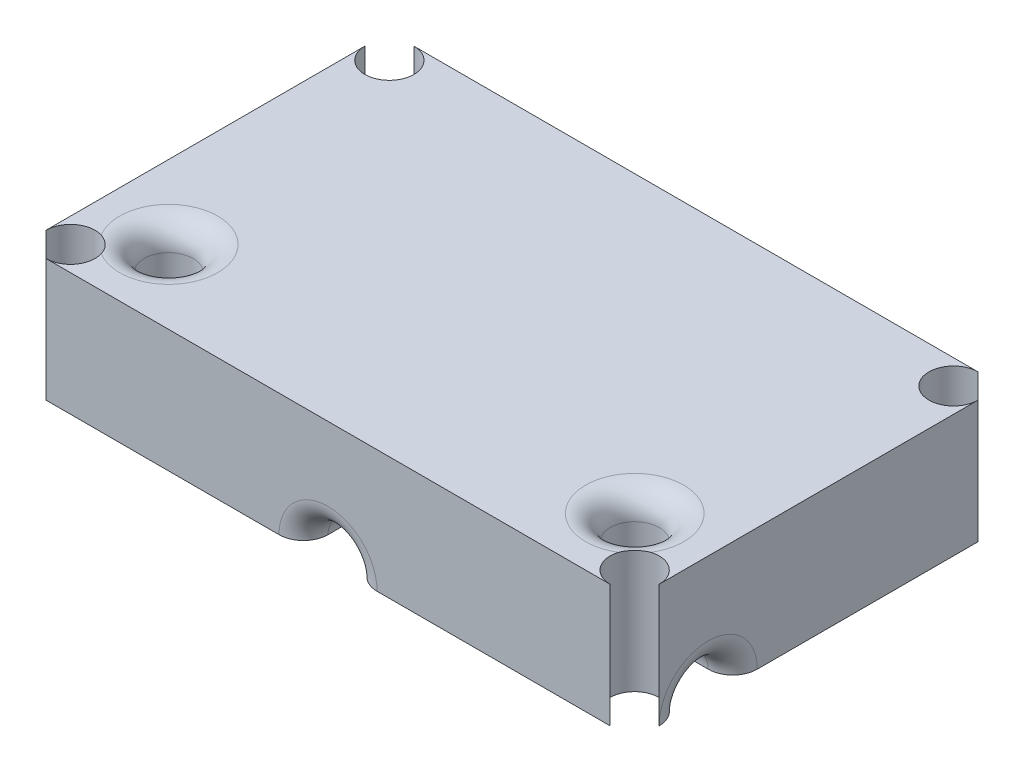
ISO-10303-21;
HEADER;
FILE_DESCRIPTION(('STEP AP214'),'2;1');
FILE_NAME('part.step','',(''),(''),'','','');
FILE_SCHEMA(('AUTOMOTIVE_DESIGN { 1 0 10303 214 1 1 1 1 }'));
ENDSEC;
DATA;
#1=APPLICATION_CONTEXT('core data for automotive mechanical design processes');
#2=APPLICATION_PROTOCOL_DEFINITION('international standard','automotive_design',2000,#1);
#3=PRODUCT_CONTEXT('',#1,'mechanical');
#4=PRODUCT('Part','Part','',(#3));
#5=PRODUCT_RELATED_PRODUCT_CATEGORY('part','',(#4));
#6=PRODUCT_DEFINITION_FORMATION('','',#4);
#7=PRODUCT_DEFINITION_CONTEXT('part definition',#1,'design');
#8=PRODUCT_DEFINITION('design','',#6,#7);
#9=PRODUCT_DEFINITION_SHAPE('','',#8);
#10=(LENGTH_UNIT() NAMED_UNIT(*) SI_UNIT(.MILLI.,.METRE.));
#11=(NAMED_UNIT(*) PLANE_ANGLE_UNIT() SI_UNIT($,.RADIAN.));
#12=(NAMED_UNIT(*) SI_UNIT($,.STERADIAN.) SOLID_ANGLE_UNIT());
#13=UNCERTAINTY_MEASURE_WITH_UNIT(LENGTH_MEASURE(1.E-05),#10,'distance_accuracy_value','');
#14=(GEOMETRIC_REPRESENTATION_CONTEXT(3) GLOBAL_UNCERTAINTY_ASSIGNED_CONTEXT((#13)) GLOBAL_UNIT_ASSIGNED_CONTEXT((#10,
#11,#12)) REPRESENTATION_CONTEXT('',''));
#15=CARTESIAN_POINT('',(0.,0.,0.));
#16=DIRECTION('',(0.,0.,1.));
#17=DIRECTION('',(1.,0.,0.));
#18=AXIS2_PLACEMENT_3D('',#15,#16,#17);
#19=CARTESIAN_POINT('',(-12.5,0.,4.5));
#20=DIRECTION('',(1.,0.,0.));
#21=DIRECTION('',(0.,0.,-1.));
#22=AXIS2_PLACEMENT_3D('',#19,#20,#21);
#23=CYLINDRICAL_SURFACE('',#22,1.);
#24=CARTESIAN_POINT('',(0.,0.,4.5));
#25=DIRECTION('',(0.707106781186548,0.,-0.707106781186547));
#26=DIRECTION('',(0.707106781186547,0.,0.707106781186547));
#27=AXIS2_PLACEMENT_3D('',#24,#25,#26);
#28=ELLIPSE('',#27,1.4142135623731,1.);
#29=CARTESIAN_POINT('',(1.,0.,5.5));
#30=VERTEX_POINT('',#29);
#31=CARTESIAN_POINT('',(0.,1.,4.5));
#32=VERTEX_POINT('',#31);
#33=EDGE_CURVE('E233',#30,#32,#28,.F.);
#34=ORIENTED_EDGE('',*,*,#33,.T.);
#35=CARTESIAN_POINT('',(0.,0.,4.5));
#36=DIRECTION('',(0.707106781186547,0.,0.707106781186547));
#37=DIRECTION('',(0.707106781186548,0.,-0.707106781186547));
#38=AXIS2_PLACEMENT_3D('',#35,#36,#37);
#39=ELLIPSE('',#38,1.41421356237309,1.);
#40=CARTESIAN_POINT('',(0.346153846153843,0.938177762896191,4.15384615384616));
#41=VERTEX_POINT('',#40);
#42=EDGE_CURVE('E218',#32,#41,#39,.F.);
#43=ORIENTED_EDGE('',*,*,#42,.T.);
#44=DIRECTION('',(1.,0.,0.));
#45=VECTOR('',#44,1.);
#46=CARTESIAN_POINT('',(-12.5,0.938177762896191,4.15384615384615));
#47=LINE('',#46,#45);
#48=CARTESIAN_POINT('',(8.56057211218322,0.938177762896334,4.15384615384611));
#49=VERTEX_POINT('',#48);
#50=EDGE_CURVE('E230',#41,#49,#47,.T.);
#51=ORIENTED_EDGE('',*,*,#50,.T.);
#52=CARTESIAN_POINT('',(9.41752061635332,0.,3.5));
#53=CARTESIAN_POINT('',(9.41756315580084,0.00647797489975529,3.49999825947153));
#54=CARTESIAN_POINT('',(9.41676117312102,0.0128660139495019,3.50006259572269));
#55=CARTESIAN_POINT('',(9.41395702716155,0.0252129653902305,3.50029991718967));
#56=CARTESIAN_POINT('',(9.41198613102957,0.0311786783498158,3.50047007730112));
#57=CARTESIAN_POINT('',(9.40425699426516,0.0502557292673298,3.50117351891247));
#58=CARTESIAN_POINT('',(9.39689407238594,0.0626496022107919,3.50189199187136));
#59=CARTESIAN_POINT('',(9.38072982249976,0.0867345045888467,3.50369472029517));
#60=CARTESIAN_POINT('',(9.37189733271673,0.0984004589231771,3.50478761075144));
#61=CARTESIAN_POINT('',(9.34213940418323,0.135780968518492,3.50891501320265));
#62=CARTESIAN_POINT('',(9.32009304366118,0.16053448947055,3.51265337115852));
#63=CARTESIAN_POINT('',(9.27553247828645,0.20929970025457,3.52183838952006));
#64=CARTESIAN_POINT('',(9.25301753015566,0.233310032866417,3.52728799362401));
#65=CARTESIAN_POINT('',(9.20810616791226,0.280588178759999,3.53986212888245));
#66=CARTESIAN_POINT('',(9.18571054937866,0.303860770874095,3.54697090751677));
#67=CARTESIAN_POINT('',(9.14110089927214,0.349950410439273,3.56291509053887));
#68=CARTESIAN_POINT('',(9.11888677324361,0.372767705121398,3.5717495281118));
#69=CARTESIAN_POINT('',(9.0671640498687,0.425713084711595,3.59453838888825));
#70=CARTESIAN_POINT('',(9.03777430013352,0.455656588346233,3.60920872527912));
#71=CARTESIAN_POINT('',(8.97984670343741,0.514538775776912,3.64187133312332));
#72=CARTESIAN_POINT('',(8.9513092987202,0.543476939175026,3.65986529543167));
#73=CARTESIAN_POINT('',(8.86738550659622,0.628469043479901,3.71910622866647));
#74=CARTESIAN_POINT('',(8.81365102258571,0.682737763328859,3.76562762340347));
#75=CARTESIAN_POINT('',(8.7331197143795,0.764019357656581,3.85318615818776));
#76=CARTESIAN_POINT('',(8.70383155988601,0.79356741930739,3.88962038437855));
#77=CARTESIAN_POINT('',(8.64952358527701,0.848358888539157,3.96841725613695));
#78=CARTESIAN_POINT('',(8.6244956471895,0.873610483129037,4.01076833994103));
#79=CARTESIAN_POINT('',(8.58406329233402,0.914431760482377,4.0931375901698));
#80=CARTESIAN_POINT('',(8.56773964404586,0.930924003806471,4.13224238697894));
#81=CARTESIAN_POINT('',(8.53986340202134,0.959128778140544,4.21376947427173));
#82=CARTESIAN_POINT('',(8.5283084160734,0.970843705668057,4.25619008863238));
#83=CARTESIAN_POINT('',(8.51075308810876,0.988715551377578,4.34365046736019));
#84=CARTESIAN_POINT('',(8.50479209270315,0.994833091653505,4.38870645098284));
#85=CARTESIAN_POINT('',(8.49910929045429,1.00082758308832,4.47961790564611));
#86=CARTESIAN_POINT('',(8.4993842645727,1.00070775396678,4.52547295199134));
#87=CARTESIAN_POINT('',(8.50574708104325,0.994638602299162,4.6109804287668));
#88=CARTESIAN_POINT('',(8.51115770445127,0.989366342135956,4.65073592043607));
#89=CARTESIAN_POINT('',(8.52645264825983,0.974351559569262,4.72848960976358));
#90=CARTESIAN_POINT('',(8.53633763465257,0.964608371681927,4.76648754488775));
#91=CARTESIAN_POINT('',(8.56047466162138,0.940766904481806,4.84141663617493));
#92=CARTESIAN_POINT('',(8.57488403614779,0.926511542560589,4.87824607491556));
#93=CARTESIAN_POINT('',(8.60719282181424,0.894521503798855,4.94869929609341));
#94=CARTESIAN_POINT('',(8.62509389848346,0.87678516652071,4.98232153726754));
#95=CARTESIAN_POINT('',(8.67415539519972,0.828163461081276,5.06340953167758));
#96=CARTESIAN_POINT('',(8.70725697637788,0.795348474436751,5.1085504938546));
#97=CARTESIAN_POINT('',(8.77819235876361,0.72505253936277,5.19082659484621));
#98=CARTESIAN_POINT('',(8.81603940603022,0.68755853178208,5.22793849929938));
#99=CARTESIAN_POINT('',(8.91016428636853,0.594441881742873,5.30726979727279));
#100=CARTESIAN_POINT('',(8.9679479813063,0.537377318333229,5.34599839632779));
#101=CARTESIAN_POINT('',(9.08728152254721,0.419999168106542,5.40997150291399));
#102=CARTESIAN_POINT('',(9.14882894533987,0.359687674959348,5.43522458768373));
#103=CARTESIAN_POINT('',(9.2475805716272,0.264967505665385,5.46492397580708));
#104=CARTESIAN_POINT('',(9.28372446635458,0.230706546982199,5.47364258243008));
#105=CARTESIAN_POINT('',(9.34535096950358,0.174663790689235,5.48488371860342));
#106=CARTESIAN_POINT('',(9.37031427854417,0.152573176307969,5.4885043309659));
#107=CARTESIAN_POINT('',(9.40575900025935,0.125004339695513,5.49218328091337));
#108=CARTESIAN_POINT('',(9.41503886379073,0.118107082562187,5.49302304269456));
#109=CARTESIAN_POINT('',(9.43422235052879,0.105177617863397,5.49447386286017));
#110=CARTESIAN_POINT('',(9.44412462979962,0.0991436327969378,5.49508539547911));
#111=CARTESIAN_POINT('',(9.45959511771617,0.091712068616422,5.49578876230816));
#112=CARTESIAN_POINT('',(9.46476677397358,0.0895277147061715,5.49598600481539));
#113=CARTESIAN_POINT('',(9.47536515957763,0.085924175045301,5.49630329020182));
#114=CARTESIAN_POINT('',(9.48079088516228,0.084502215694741,5.49642361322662));
#115=CARTESIAN_POINT('',(9.4919173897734,0.082691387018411,5.49657571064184));
#116=CARTESIAN_POINT('',(9.49762119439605,0.0823195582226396,5.49660602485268));
#117=CARTESIAN_POINT('',(9.50897954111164,0.0827707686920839,5.49656862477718));
#118=CARTESIAN_POINT('',(9.51463405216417,0.0835945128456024,5.49650085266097));
#119=CARTESIAN_POINT('',(9.52705533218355,0.0865274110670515,5.49625063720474));
#120=CARTESIAN_POINT('',(9.53375468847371,0.0889023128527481,5.49604414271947));
#121=CARTESIAN_POINT('',(9.54675429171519,0.0945943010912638,5.49552031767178));
#122=CARTESIAN_POINT('',(9.55305184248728,0.0979170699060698,5.49520231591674));
#123=CARTESIAN_POINT('',(9.58388053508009,0.115717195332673,5.49338010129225));
#124=CARTESIAN_POINT('',(9.60622307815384,0.133658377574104,5.49118708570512));
#125=CARTESIAN_POINT('',(9.64981480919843,0.170550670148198,5.48554183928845));
#126=CARTESIAN_POINT('',(9.67105621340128,0.189507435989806,5.48208175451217));
#127=CARTESIAN_POINT('',(9.72914372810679,0.242634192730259,5.4707268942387));
#128=CARTESIAN_POINT('',(9.76538014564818,0.277253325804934,5.46147053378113));
#129=CARTESIAN_POINT('',(9.83689333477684,0.346188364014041,5.43887693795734));
#130=CARTESIAN_POINT('',(9.87216872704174,0.380503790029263,5.42553414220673));
#131=CARTESIAN_POINT('',(9.94148681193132,0.448283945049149,5.39466115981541));
#132=CARTESIAN_POINT('',(9.97553300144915,0.481750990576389,5.37714414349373));
#133=CARTESIAN_POINT('',(10.0422073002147,0.54743004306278,5.3377279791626));
#134=CARTESIAN_POINT('',(10.0748366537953,0.579643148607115,5.3158327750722));
#135=CARTESIAN_POINT('',(10.1460683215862,0.650052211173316,5.26148890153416));
#136=CARTESIAN_POINT('',(10.1841784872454,0.687783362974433,5.22776884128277));
#137=CARTESIAN_POINT('',(10.2564174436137,0.759344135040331,5.1527462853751));
#138=CARTESIAN_POINT('',(10.2905507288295,0.793178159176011,5.11145248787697));
#139=CARTESIAN_POINT('',(10.3469886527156,0.849118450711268,5.03002892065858));
#140=CARTESIAN_POINT('',(10.3702971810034,0.872220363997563,4.99128774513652));
#141=CARTESIAN_POINT('',(10.4121696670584,0.913697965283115,4.90898762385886));
#142=CARTESIAN_POINT('',(10.4307396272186,0.93207963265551,4.865434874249));
#143=CARTESIAN_POINT('',(10.4592517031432,0.960256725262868,4.78196707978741));
#144=CARTESIAN_POINT('',(10.4701223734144,0.970979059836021,4.74268508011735));
#145=CARTESIAN_POINT('',(10.4870632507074,0.987627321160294,4.66211246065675));
#146=CARTESIAN_POINT('',(10.4931364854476,0.993556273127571,4.62082312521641));
#147=CARTESIAN_POINT('',(10.5000553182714,1.00018751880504,4.53724554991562));
#148=CARTESIAN_POINT('',(10.5008836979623,1.00087259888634,4.49495447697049));
#149=CARTESIAN_POINT('',(10.4972069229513,0.996908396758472,4.41085903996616));
#150=CARTESIAN_POINT('',(10.4927012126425,0.992258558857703,4.36905472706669));
#151=CARTESIAN_POINT('',(10.479057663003,0.97833070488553,4.28921161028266));
#152=CARTESIAN_POINT('',(10.4701586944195,0.969291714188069,4.25108874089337));
#153=CARTESIAN_POINT('',(10.4484082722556,0.947255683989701,4.17720672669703));
#154=CARTESIAN_POINT('',(10.4355553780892,0.93425720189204,4.14144844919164));
#155=CARTESIAN_POINT('',(10.4009678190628,0.89931213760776,4.05966125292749));
#156=CARTESIAN_POINT('',(10.377715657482,0.875843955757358,4.01492318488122));
#157=CARTESIAN_POINT('',(10.3264088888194,0.824075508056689,3.93138147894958));
#158=CARTESIAN_POINT('',(10.2983441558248,0.795765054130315,3.89259068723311));
#159=CARTESIAN_POINT('',(10.227582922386,0.724362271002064,3.80759489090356));
#160=CARTESIAN_POINT('',(10.1833324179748,0.679694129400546,3.76401798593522));
#161=CARTESIAN_POINT('',(10.090625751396,0.585971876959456,3.68740538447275));
#162=CARTESIAN_POINT('',(10.0421648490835,0.536912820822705,3.6543817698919));
#163=CARTESIAN_POINT('',(9.96353242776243,0.456984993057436,3.60988984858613));
#164=CARTESIAN_POINT('',(9.93416681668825,0.427067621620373,3.59517698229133));
#165=CARTESIAN_POINT('',(9.87498436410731,0.366501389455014,3.56899943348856));
#166=CARTESIAN_POINT('',(9.8451696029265,0.335855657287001,3.55752289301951));
#167=CARTESIAN_POINT('',(9.79572390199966,0.284535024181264,3.54109787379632));
#168=CARTESIAN_POINT('',(9.77614593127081,0.264086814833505,3.53526559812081));
#169=CARTESIAN_POINT('',(9.73695322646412,0.22261508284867,3.52485778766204));
#170=CARTESIAN_POINT('',(9.71733931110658,0.201588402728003,3.52029197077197));
#171=CARTESIAN_POINT('',(9.67831276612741,0.158654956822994,3.51241931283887));
#172=CARTESIAN_POINT('',(9.65890447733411,0.136741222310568,3.50912633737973));
#173=CARTESIAN_POINT('',(9.63141648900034,0.10268288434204,3.50522183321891));
#174=CARTESIAN_POINT('',(9.62257277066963,0.0912043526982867,3.50409653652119));
#175=CARTESIAN_POINT('',(9.60608232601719,0.0674069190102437,3.50220277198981));
#176=CARTESIAN_POINT('',(9.59842673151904,0.0550953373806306,3.50143156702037));
#177=CARTESIAN_POINT('',(9.59014080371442,0.0367106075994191,3.50066056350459));
#178=CARTESIAN_POINT('',(9.58805404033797,0.0313372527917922,3.50047574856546));
#179=CARTESIAN_POINT('',(9.58478383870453,0.0203410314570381,3.50019202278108));
#180=CARTESIAN_POINT('',(9.58359412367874,0.0147201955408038,3.5000925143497));
#181=CARTESIAN_POINT('',(9.58264282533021,0.00603966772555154,3.50001357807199));
#182=CARTESIAN_POINT('',(9.58247239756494,0.00302169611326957,3.49999965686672));
#183=CARTESIAN_POINT('',(9.58247938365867,-1.30170229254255E-12,3.49999999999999));
#184=B_SPLINE_CURVE_WITH_KNOTS('',3,(#52,#53,#54,#55,#56,#57,#58,#59,#60,#61,#62,#63,#64,#65,
#66,#67,#68,#69,#70,#71,#72,#73,#74,#75,#76,#77,#78,#79,#80,#81,#82,#83,#84,#85,#86,#87,#88,#89,
#90,#91,#92,#93,#94,#95,#96,#97,#98,#99,#100,#101,#102,#103,#104,#105,#106,#107,#108,#109,#110,
#111,#112,#113,#114,#115,#116,#117,#118,#119,#120,#121,#122,#123,#124,#125,#126,#127,#128,#129,
#130,#131,#132,#133,#134,#135,#136,#137,#138,#139,#140,#141,#142,#143,#144,#145,#146,#147,#148,
#149,#150,#151,#152,#153,#154,#155,#156,#157,#158,#159,#160,#161,#162,#163,#164,#165,#166,#167,
#168,#169,#170,#171,#172,#173,#174,#175,#176,#177,#178,#179,#180,#181,#182,#183),.UNSPECIFIED.,
.F.,.F.,(4,2,2,2,2,2,2,2,2,2,2,2,2,2,2,2,2,2,2,2,2,2,2,2,2,2,2,2,2,2,2,2,2,2,2,2,2,2,2,2,2,2,2,
2,2,2,2,2,2,2,2,2,2,2,2,2,2,2,2,2,2,2,2,2,2,4),(0.,0.0192442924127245,0.0379956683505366,
0.0809539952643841,0.124978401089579,0.22487631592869,0.324947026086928,0.424103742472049,
0.523205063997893,0.656389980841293,0.78964284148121,1.05598738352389,1.22139569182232,
1.38648519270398,1.52236064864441,1.65816785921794,1.79492329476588,1.93160813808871,
2.05245553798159,2.17332093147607,2.29896921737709,2.42467758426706,2.61824631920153,
2.81236792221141,3.0808635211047,3.34918801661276,3.50076106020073,3.60117303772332,
3.63594044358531,3.67063519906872,3.68744875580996,3.70420072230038,3.72122300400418,
3.73825532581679,3.75946573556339,3.78080607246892,3.86639737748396,3.95252845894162,
4.10513764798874,4.25795542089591,4.41029726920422,4.56250249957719,4.75195156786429,
4.94118440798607,5.0929467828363,5.24451595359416,5.37041657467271,5.49623767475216,
5.62247162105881,5.74871871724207,5.86875288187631,5.98883083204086,6.15475209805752,
6.32102685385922,6.54929641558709,6.77782638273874,6.91099986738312,7.04367886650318,
7.130358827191,7.21768658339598,7.30594049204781,7.34954825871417,7.39281301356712,
7.4100648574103,7.42719483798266,7.43624979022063),.UNSPECIFIED.);
#185=CARTESIAN_POINT('',(9.58247938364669,0.,3.5));
#186=VERTEX_POINT('',#185);
#187=EDGE_CURVE('E248',#49,#186,#184,.T.);
#188=ORIENTED_EDGE('',*,*,#187,.T.);
#189=DIRECTION('',(1.,0.,0.));
#190=VECTOR('',#189,1.);
#191=CARTESIAN_POINT('',(-12.5,0.,3.5));
#192=LINE('',#191,#190);
#193=CARTESIAN_POINT('',(11.5,0.,3.5));
#194=VERTEX_POINT('',#193);
#195=EDGE_CURVE('E320',#186,#194,#192,.T.);
#196=ORIENTED_EDGE('',*,*,#195,.T.);
#197=CARTESIAN_POINT('',(11.5,0.,4.5));
#198=DIRECTION('',(-1.,0.,0.));
#199=DIRECTION('',(0.,0.,1.));
#200=AXIS2_PLACEMENT_3D('',#197,#198,#199);
#201=CIRCLE('',#200,1.);
#202=CARTESIAN_POINT('',(11.5,0.,5.5));
#203=VERTEX_POINT('',#202);
#204=EDGE_CURVE('E625',#194,#203,#201,.F.);
#205=ORIENTED_EDGE('',*,*,#204,.T.);
#206=DIRECTION('',(1.,0.,0.));
#207=VECTOR('',#206,1.);
#208=CARTESIAN_POINT('',(-12.5,0.,5.5));
#209=LINE('',#208,#207);
#210=EDGE_CURVE('E325',#203,#30,#209,.F.);
#211=ORIENTED_EDGE('',*,*,#210,.T.);
#212=EDGE_LOOP('',(#34,#43,#51,#188,#196,#205,#211));
#213=FACE_BOUND('',#212,.T.);
#214=ADVANCED_FACE('F46',(#213),#23,.F.);
#215=CARTESIAN_POINT('',(-11.5,0.,6.5));
#216=DIRECTION('',(0.,-1.,0.));
#217=DIRECTION('',(0.,0.,-1.));
#218=AXIS2_PLACEMENT_3D('',#215,#216,#217);
#219=PLANE('',#218);
#220=DIRECTION('',(1.,0.,0.));
#221=VECTOR('',#220,1.);
#222=CARTESIAN_POINT('',(11.5,0.,7.5));
#223=LINE('',#222,#221);
#224=CARTESIAN_POINT('',(2.,0.,7.5));
#225=VERTEX_POINT('',#224);
#226=CARTESIAN_POINT('',(11.5,0.,7.5));
#227=VERTEX_POINT('',#226);
#228=EDGE_CURVE('E393',#225,#227,#223,.T.);
#229=ORIENTED_EDGE('',*,*,#228,.F.);
#230=CARTESIAN_POINT('',(2.,0.,6.5));
#231=DIRECTION('',(0.,-1.,0.));
#232=DIRECTION('',(0.,0.,-1.));
#233=AXIS2_PLACEMENT_3D('',#230,#231,#232);
#234=CIRCLE('',#233,1.);
#235=CARTESIAN_POINT('',(1.,0.,6.5));
#236=VERTEX_POINT('',#235);
#237=EDGE_CURVE('E68',#225,#236,#234,.T.);
#238=ORIENTED_EDGE('',*,*,#237,.T.);
#239=DIRECTION('',(0.,0.,1.));
#240=VECTOR('',#239,1.);
#241=CARTESIAN_POINT('',(1.,0.,-7.50002499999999));
#242=LINE('',#241,#240);
#243=EDGE_CURVE('E573',#30,#236,#242,.T.);
#244=ORIENTED_EDGE('',*,*,#243,.F.);
#245=ORIENTED_EDGE('',*,*,#210,.F.);
#246=CARTESIAN_POINT('',(11.5,0.,6.5));
#247=DIRECTION('',(0.,-1.,0.));
#248=DIRECTION('',(0.,0.,1.));
#249=AXIS2_PLACEMENT_3D('',#246,#247,#248);
#250=CIRCLE('',#249,1.);
#251=EDGE_CURVE('E584',#227,#203,#250,.T.);
#252=ORIENTED_EDGE('',*,*,#251,.F.);
#253=EDGE_LOOP('',(#229,#238,#244,#245,#252));
#254=FACE_BOUND('',#253,.T.);
#255=ADVANCED_FACE('F551',(#254),#219,.T.);
#256=DIRECTION('',(-1.,0.,0.));
#257=VECTOR('',#256,1.);
#258=CARTESIAN_POINT('',(11.5,0.,-7.5));
#259=LINE('',#258,#257);
#260=CARTESIAN_POINT('',(-9.5,0.,-7.49999999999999));
#261=VERTEX_POINT('',#260);
#262=CARTESIAN_POINT('',(-11.5,0.,-7.5));
#263=VERTEX_POINT('',#262);
#264=EDGE_CURVE('E593',#261,#263,#259,.T.);
#265=ORIENTED_EDGE('',*,*,#264,.F.);
#266=DIRECTION('',(0.,0.,1.));
#267=VECTOR('',#266,1.);
#268=CARTESIAN_POINT('',(-9.5,0.,6.5));
#269=LINE('',#268,#267);
#270=CARTESIAN_POINT('',(-9.5,0.,3.49659277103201));
#271=VERTEX_POINT('',#270);
#272=EDGE_CURVE('E468',#261,#271,#269,.T.);
#273=ORIENTED_EDGE('',*,*,#272,.T.);
#274=CARTESIAN_POINT('',(-9.5,0.,4.49659277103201));
#275=DIRECTION('',(0.,-1.,0.));
#276=DIRECTION('',(-0.0824793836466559,0.,-0.996592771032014));
#277=AXIS2_PLACEMENT_3D('',#274,#275,#276);
#278=CIRCLE('',#277,1.);
#279=CARTESIAN_POINT('',(-9.58247938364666,0.,3.5));
#280=VERTEX_POINT('',#279);
#281=EDGE_CURVE('E479',#280,#271,#278,.T.);
#282=ORIENTED_EDGE('',*,*,#281,.F.);
#283=CARTESIAN_POINT('',(-11.5,0.,3.5));
#284=VERTEX_POINT('',#283);
#285=EDGE_CURVE('E316',#284,#280,#192,.T.);
#286=ORIENTED_EDGE('',*,*,#285,.F.);
#287=CARTESIAN_POINT('',(-11.5,0.,2.5));
#288=DIRECTION('',(0.,-1.,0.));
#289=DIRECTION('',(0.,0.,-1.));
#290=AXIS2_PLACEMENT_3D('',#287,#288,#289);
#291=CIRCLE('',#290,1.);
#292=CARTESIAN_POINT('',(-12.5,0.,2.5));
#293=VERTEX_POINT('',#292);
#294=EDGE_CURVE('E344',#284,#293,#291,.T.);
#295=ORIENTED_EDGE('',*,*,#294,.T.);
#296=DIRECTION('',(0.,0.,1.));
#297=VECTOR('',#296,1.);
#298=CARTESIAN_POINT('',(-12.5,0.,6.5));
#299=LINE('',#298,#297);
#300=CARTESIAN_POINT('',(-12.5,0.,-6.5));
#301=VERTEX_POINT('',#300);
#302=EDGE_CURVE('E360',#301,#293,#299,.T.);
#303=ORIENTED_EDGE('',*,*,#302,.F.);
#304=CARTESIAN_POINT('',(-11.5,0.,-6.5));
#305=DIRECTION('',(0.,-1.,0.));
#306=DIRECTION('',(0.,0.,1.));
#307=AXIS2_PLACEMENT_3D('',#304,#305,#306);
#308=CIRCLE('',#307,1.);
#309=EDGE_CURVE('E365',#263,#301,#308,.T.);
#310=ORIENTED_EDGE('',*,*,#309,.F.);
#311=EDGE_LOOP('',(#265,#273,#282,#286,#295,#303,#310));
#312=FACE_BOUND('',#311,.T.);
#313=ADVANCED_FACE('F557',(#312),#219,.T.);
#314=CARTESIAN_POINT('',(9.58247938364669,0.,3.5));
#315=CARTESIAN_POINT('',(9.5,0.,3.49317389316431));
#316=CARTESIAN_POINT('',(9.41752061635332,0.,3.5));
#317=B_SPLINE_CURVE_WITH_KNOTS('',2,(#314,#315,#316),.UNSPECIFIED.,.F.,.F.,(3,3),(0.,1.),.UNSPECIFIED.);
#318=CARTESIAN_POINT('',(9.49999999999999,0.,3.49659277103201));
#319=VERTEX_POINT('',#318);
#320=EDGE_CURVE('E474',#186,#319,#317,.T.);
#321=ORIENTED_EDGE('',*,*,#320,.T.);
#322=DIRECTION('',(0.,0.,-1.));
#323=VECTOR('',#322,1.);
#324=CARTESIAN_POINT('',(9.49999999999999,0.,6.50000000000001));
#325=LINE('',#324,#323);
#326=CARTESIAN_POINT('',(9.49999999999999,0.,-7.49999999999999));
#327=VERTEX_POINT('',#326);
#328=EDGE_CURVE('E470',#319,#327,#325,.T.);
#329=ORIENTED_EDGE('',*,*,#328,.T.);
#330=CARTESIAN_POINT('',(11.5,0.,-7.5));
#331=VERTEX_POINT('',#330);
#332=EDGE_CURVE('E594',#331,#327,#259,.T.);
#333=ORIENTED_EDGE('',*,*,#332,.F.);
#334=CARTESIAN_POINT('',(11.5,0.,-6.5));
#335=DIRECTION('',(0.,-1.,0.));
#336=DIRECTION('',(0.,0.,-1.));
#337=AXIS2_PLACEMENT_3D('',#334,#335,#336);
#338=CIRCLE('',#337,1.);
#339=CARTESIAN_POINT('',(12.5,0.,-6.5));
#340=VERTEX_POINT('',#339);
#341=EDGE_CURVE('E591',#340,#331,#338,.T.);
#342=ORIENTED_EDGE('',*,*,#341,.F.);
#343=DIRECTION('',(0.,0.,-1.));
#344=VECTOR('',#343,1.);
#345=CARTESIAN_POINT('',(12.5,0.,6.5));
#346=LINE('',#345,#344);
#347=CARTESIAN_POINT('',(12.5,0.,2.5));
#348=VERTEX_POINT('',#347);
#349=EDGE_CURVE('E587',#348,#340,#346,.T.);
#350=ORIENTED_EDGE('',*,*,#349,.F.);
#351=CARTESIAN_POINT('',(11.5,0.,2.5));
#352=DIRECTION('',(0.,-1.,0.));
#353=DIRECTION('',(0.,0.,-1.));
#354=AXIS2_PLACEMENT_3D('',#351,#352,#353);
#355=CIRCLE('',#354,1.);
#356=EDGE_CURVE('E339',#348,#194,#355,.T.);
#357=ORIENTED_EDGE('',*,*,#356,.T.);
#358=ORIENTED_EDGE('',*,*,#195,.F.);
#359=EDGE_LOOP('',(#321,#329,#333,#342,#350,#357,#358));
#360=FACE_BOUND('',#359,.T.);
#361=ADVANCED_FACE('F558',(#360),#219,.T.);
#362=CARTESIAN_POINT('',(11.5,5.,-7.5));
#363=DIRECTION('',(0.,0.,1.));
#364=DIRECTION('',(1.,0.,0.));
#365=AXIS2_PLACEMENT_3D('',#362,#363,#364);
#366=PLANE('',#365);
#367=DIRECTION('',(0.,1.,0.));
#368=VECTOR('',#367,1.);
#369=CARTESIAN_POINT('',(-9.5,-0.111851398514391,-7.49999999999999));
#370=LINE('',#369,#368);
#371=CARTESIAN_POINT('',(-9.5,3.,-7.49999999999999));
#372=VERTEX_POINT('',#371);
#373=EDGE_CURVE('E455',#261,#372,#370,.T.);
#374=ORIENTED_EDGE('',*,*,#373,.F.);
#375=ORIENTED_EDGE('',*,*,#264,.T.);
#376=DIRECTION('',(0.,-1.,0.));
#377=VECTOR('',#376,1.);
#378=CARTESIAN_POINT('',(-11.5,5.,-7.5));
#379=LINE('',#378,#377);
#380=CARTESIAN_POINT('',(-11.5,5.,-7.5));
#381=VERTEX_POINT('',#380);
#382=EDGE_CURVE('E606',#381,#263,#379,.T.);
#383=ORIENTED_EDGE('',*,*,#382,.F.);
#384=DIRECTION('',(-1.,0.,0.));
#385=VECTOR('',#384,1.);
#386=CARTESIAN_POINT('',(11.5,5.,-7.5));
#387=LINE('',#386,#385);
#388=CARTESIAN_POINT('',(11.5,5.,-7.5));
#389=VERTEX_POINT('',#388);
#390=EDGE_CURVE('E449',#389,#381,#387,.T.);
#391=ORIENTED_EDGE('',*,*,#390,.F.);
#392=DIRECTION('',(0.,-1.,0.));
#393=VECTOR('',#392,1.);
#394=CARTESIAN_POINT('',(11.5,5.,-7.5));
#395=LINE('',#394,#393);
#396=EDGE_CURVE('E615',#389,#331,#395,.T.);
#397=ORIENTED_EDGE('',*,*,#396,.T.);
#398=ORIENTED_EDGE('',*,*,#332,.T.);
#399=DIRECTION('',(0.,1.,0.));
#400=VECTOR('',#399,1.);
#401=CARTESIAN_POINT('',(9.49999999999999,-0.111851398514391,-7.49999999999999));
#402=LINE('',#401,#400);
#403=CARTESIAN_POINT('',(9.49999999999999,3.,-7.49999999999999));
#404=VERTEX_POINT('',#403);
#405=EDGE_CURVE('E460',#327,#404,#402,.T.);
#406=ORIENTED_EDGE('',*,*,#405,.T.);
#407=DIRECTION('',(1.,0.,0.));
#408=VECTOR('',#407,1.);
#409=CARTESIAN_POINT('',(-9.5,3.,-7.49999999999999));
#410=LINE('',#409,#408);
#411=EDGE_CURVE('E579',#372,#404,#410,.T.);
#412=ORIENTED_EDGE('',*,*,#411,.F.);
#413=EDGE_LOOP('',(#374,#375,#383,#391,#397,#398,#406,#412));
#414=FACE_BOUND('',#413,.T.);
#415=ADVANCED_FACE('F559',(#414),#366,.F.);
#416=CARTESIAN_POINT('',(0.,0.,4.5));
#417=DIRECTION('',(0.707106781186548,0.,-0.707106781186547));
#418=DIRECTION('',(0.707106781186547,0.,0.707106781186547));
#419=AXIS2_PLACEMENT_3D('',#416,#417,#418);
#420=ELLIPSE('',#419,1.4142135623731,1.);
#421=CARTESIAN_POINT('',(-0.346153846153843,0.938177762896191,4.15384615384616));
#422=VERTEX_POINT('',#421);
#423=EDGE_CURVE('E221',#422,#32,#420,.T.);
#424=ORIENTED_EDGE('',*,*,#423,.T.);
#425=CARTESIAN_POINT('',(0.,0.,4.5));
#426=DIRECTION('',(0.707106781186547,0.,0.707106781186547));
#427=DIRECTION('',(0.707106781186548,0.,-0.707106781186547));
#428=AXIS2_PLACEMENT_3D('',#425,#426,#427);
#429=ELLIPSE('',#428,1.41421356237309,1.);
#430=CARTESIAN_POINT('',(-1.,0.,5.5));
#431=VERTEX_POINT('',#430);
#432=EDGE_CURVE('E235',#32,#431,#429,.T.);
#433=ORIENTED_EDGE('',*,*,#432,.T.);
#434=CARTESIAN_POINT('',(-11.5,0.,5.5));
#435=VERTEX_POINT('',#434);
#436=EDGE_CURVE('E423',#431,#435,#209,.F.);
#437=ORIENTED_EDGE('',*,*,#436,.T.);
#438=CARTESIAN_POINT('',(-11.5,0.,4.5));
#439=DIRECTION('',(1.,0.,0.));
#440=DIRECTION('',(0.,0.,-1.));
#441=AXIS2_PLACEMENT_3D('',#438,#439,#440);
#442=CIRCLE('',#441,1.);
#443=EDGE_CURVE('E345',#435,#284,#442,.F.);
#444=ORIENTED_EDGE('',*,*,#443,.T.);
#445=ORIENTED_EDGE('',*,*,#285,.T.);
#446=CARTESIAN_POINT('',(-9.58247938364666,0.,3.5));
#447=CARTESIAN_POINT('',(-9.58243684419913,0.00647797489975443,3.49999825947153));
#448=CARTESIAN_POINT('',(-9.58323882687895,0.0128660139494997,3.50006259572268));
#449=CARTESIAN_POINT('',(-9.58604297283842,0.0252129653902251,3.50029991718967));
#450=CARTESIAN_POINT('',(-9.58801386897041,0.0311786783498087,3.50047007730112));
#451=CARTESIAN_POINT('',(-9.59574300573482,0.0502557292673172,3.50117351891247));
#452=CARTESIAN_POINT('',(-9.60310592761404,0.0626496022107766,3.50189199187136));
#453=CARTESIAN_POINT('',(-9.61927017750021,0.0867345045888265,3.50369472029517));
#454=CARTESIAN_POINT('',(-9.62810266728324,0.098400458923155,3.50478761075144));
#455=CARTESIAN_POINT('',(-9.65786059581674,0.135780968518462,3.50891501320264));
#456=CARTESIAN_POINT('',(-9.67990695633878,0.160534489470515,3.51265337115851));
#457=CARTESIAN_POINT('',(-9.7244675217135,0.209299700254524,3.52183838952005));
#458=CARTESIAN_POINT('',(-9.74698246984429,0.233310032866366,3.52728799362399));
#459=CARTESIAN_POINT('',(-9.79189383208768,0.28058817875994,3.53986212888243));
#460=CARTESIAN_POINT('',(-9.81428945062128,0.303860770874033,3.54697090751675));
#461=CARTESIAN_POINT('',(-9.85889910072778,0.349950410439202,3.56291509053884));
#462=CARTESIAN_POINT('',(-9.88111322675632,0.372767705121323,3.57174952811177));
#463=CARTESIAN_POINT('',(-9.93283595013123,0.425713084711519,3.59453838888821));
#464=CARTESIAN_POINT('',(-9.9622256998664,0.455656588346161,3.60920872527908));
#465=CARTESIAN_POINT('',(-10.0201532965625,0.514538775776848,3.64187133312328));
#466=CARTESIAN_POINT('',(-10.0486907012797,0.543476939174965,3.65986529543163));
#467=CARTESIAN_POINT('',(-10.1326144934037,0.62846904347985,3.71910622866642));
#468=CARTESIAN_POINT('',(-10.1863489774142,0.682737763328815,3.76562762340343));
#469=CARTESIAN_POINT('',(-10.2668802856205,0.764019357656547,3.85318615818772));
#470=CARTESIAN_POINT('',(-10.296168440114,0.793567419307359,3.88962038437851));
#471=CARTESIAN_POINT('',(-10.350476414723,0.848358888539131,3.96841725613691));
#472=CARTESIAN_POINT('',(-10.3755043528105,0.873610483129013,4.01076833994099));
#473=CARTESIAN_POINT('',(-10.415936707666,0.914431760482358,4.09313759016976));
#474=CARTESIAN_POINT('',(-10.4322603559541,0.930924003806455,4.1322423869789));
#475=CARTESIAN_POINT('',(-10.4601365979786,0.959128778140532,4.21376947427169));
#476=CARTESIAN_POINT('',(-10.4716915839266,0.970843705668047,4.25619008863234));
#477=CARTESIAN_POINT('',(-10.4892469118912,0.988715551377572,4.34365046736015));
#478=CARTESIAN_POINT('',(-10.4952079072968,0.994833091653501,4.38870645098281));
#479=CARTESIAN_POINT('',(-10.5008907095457,1.00082758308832,4.47961790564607));
#480=CARTESIAN_POINT('',(-10.5006157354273,1.00070775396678,4.52547295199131));
#481=CARTESIAN_POINT('',(-10.4942529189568,0.994638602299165,4.61098042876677));
#482=CARTESIAN_POINT('',(-10.4888422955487,0.989366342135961,4.65073592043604));
#483=CARTESIAN_POINT('',(-10.4735473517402,0.974351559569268,4.72848960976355));
#484=CARTESIAN_POINT('',(-10.4636623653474,0.964608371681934,4.76648754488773));
#485=CARTESIAN_POINT('',(-10.4395253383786,0.940766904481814,4.8414166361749));
#486=CARTESIAN_POINT('',(-10.4251159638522,0.926511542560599,4.87824607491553));
#487=CARTESIAN_POINT('',(-10.3928071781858,0.894521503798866,4.94869929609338));
#488=CARTESIAN_POINT('',(-10.3749061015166,0.876785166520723,4.98232153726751));
#489=CARTESIAN_POINT('',(-10.3258446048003,0.828163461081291,5.06340953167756));
#490=CARTESIAN_POINT('',(-10.2927430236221,0.795348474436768,5.10855049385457));
#491=CARTESIAN_POINT('',(-10.2218076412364,0.72505253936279,5.19082659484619));
#492=CARTESIAN_POINT('',(-10.1839605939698,0.687558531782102,5.22793849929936));
#493=CARTESIAN_POINT('',(-10.0898357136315,0.594441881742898,5.30726979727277));
#494=CARTESIAN_POINT('',(-10.0320520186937,0.537377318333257,5.34599839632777));
#495=CARTESIAN_POINT('',(-9.91271847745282,0.419999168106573,5.40997150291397));
#496=CARTESIAN_POINT('',(-9.85117105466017,0.359687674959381,5.43522458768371));
#497=CARTESIAN_POINT('',(-9.75241942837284,0.264967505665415,5.46492397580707));
#498=CARTESIAN_POINT('',(-9.71627553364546,0.230706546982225,5.47364258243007));
#499=CARTESIAN_POINT('',(-9.65464903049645,0.174663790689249,5.48488371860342));
#500=CARTESIAN_POINT('',(-9.62968572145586,0.152573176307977,5.48850433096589));
#501=CARTESIAN_POINT('',(-9.59424099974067,0.125004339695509,5.49218328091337));
#502=CARTESIAN_POINT('',(-9.58496113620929,0.11810708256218,5.49302304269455));
#503=CARTESIAN_POINT('',(-9.56577764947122,0.105177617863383,5.49447386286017));
#504=CARTESIAN_POINT('',(-9.55587537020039,0.0991436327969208,5.49508539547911));
#505=CARTESIAN_POINT('',(-9.54040488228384,0.0917120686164,5.49578876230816));
#506=CARTESIAN_POINT('',(-9.53523322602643,0.0895277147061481,5.49598600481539));
#507=CARTESIAN_POINT('',(-9.52463484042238,0.0859241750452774,5.49630329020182));
#508=CARTESIAN_POINT('',(-9.51920911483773,0.0845022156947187,5.49642361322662));
#509=CARTESIAN_POINT('',(-9.50808261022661,0.0826913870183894,5.49657571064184));
#510=CARTESIAN_POINT('',(-9.50237880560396,0.0823195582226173,5.49660602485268));
#511=CARTESIAN_POINT('',(-9.49102045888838,0.0827707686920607,5.49656862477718));
#512=CARTESIAN_POINT('',(-9.48536594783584,0.083594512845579,5.49650085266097));
#513=CARTESIAN_POINT('',(-9.47294466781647,0.0865274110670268,5.49625063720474));
#514=CARTESIAN_POINT('',(-9.4662453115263,0.0889023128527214,5.49604414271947));
#515=CARTESIAN_POINT('',(-9.45324570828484,0.094594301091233,5.49552031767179));
#516=CARTESIAN_POINT('',(-9.44694815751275,0.0979170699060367,5.49520231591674));
#517=CARTESIAN_POINT('',(-9.41611946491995,0.115717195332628,5.49338010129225));
#518=CARTESIAN_POINT('',(-9.39377692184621,0.133658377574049,5.49118708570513));
#519=CARTESIAN_POINT('',(-9.35018519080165,0.170550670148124,5.48554183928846));
#520=CARTESIAN_POINT('',(-9.32894378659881,0.189507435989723,5.48208175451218));
#521=CARTESIAN_POINT('',(-9.2708562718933,0.242634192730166,5.47072689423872));
#522=CARTESIAN_POINT('',(-9.23461985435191,0.277253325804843,5.46147053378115));
#523=CARTESIAN_POINT('',(-9.16310666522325,0.346188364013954,5.43887693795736));
#524=CARTESIAN_POINT('',(-9.12783127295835,0.380503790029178,5.42553414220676));
#525=CARTESIAN_POINT('',(-9.05851318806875,0.44828394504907,5.39466115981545));
#526=CARTESIAN_POINT('',(-9.02446699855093,0.481750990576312,5.37714414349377));
#527=CARTESIAN_POINT('',(-8.95779269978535,0.547430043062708,5.33772797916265));
#528=CARTESIAN_POINT('',(-8.92516334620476,0.579643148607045,5.31583277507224));
#529=CARTESIAN_POINT('',(-8.85393167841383,0.650052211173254,5.26148890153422));
#530=CARTESIAN_POINT('',(-8.81582151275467,0.687783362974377,5.22776884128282));
#531=CARTESIAN_POINT('',(-8.74358255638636,0.759344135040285,5.15274628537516));
#532=CARTESIAN_POINT('',(-8.70944927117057,0.793178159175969,5.11145248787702));
#533=CARTESIAN_POINT('',(-8.65301134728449,0.849118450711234,5.03002892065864));
#534=CARTESIAN_POINT('',(-8.62970281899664,0.872220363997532,4.99128774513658));
#535=CARTESIAN_POINT('',(-8.58783033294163,0.91369796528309,4.90898762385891));
#536=CARTESIAN_POINT('',(-8.56926037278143,0.932079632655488,4.86543487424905));
#537=CARTESIAN_POINT('',(-8.54074829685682,0.960256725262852,4.78196707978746));
#538=CARTESIAN_POINT('',(-8.52987762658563,0.970979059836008,4.7426850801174));
#539=CARTESIAN_POINT('',(-8.51293674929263,0.987627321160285,4.6621124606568));
#540=CARTESIAN_POINT('',(-8.50686351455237,0.993556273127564,4.62082312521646));
#541=CARTESIAN_POINT('',(-8.49994468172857,1.00018751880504,4.53724554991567));
#542=CARTESIAN_POINT('',(-8.49911630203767,1.00087259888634,4.49495447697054));
#543=CARTESIAN_POINT('',(-8.5027930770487,0.996908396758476,4.41085903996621));
#544=CARTESIAN_POINT('',(-8.50729878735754,0.992258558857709,4.36905472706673));
#545=CARTESIAN_POINT('',(-8.520942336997,0.978330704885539,4.2892116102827));
#546=CARTESIAN_POINT('',(-8.52984130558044,0.96929171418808,4.25108874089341));
#547=CARTESIAN_POINT('',(-8.55159172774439,0.947255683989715,4.17720672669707));
#548=CARTESIAN_POINT('',(-8.56444462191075,0.934257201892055,4.14144844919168));
#549=CARTESIAN_POINT('',(-8.59903218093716,0.89931213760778,4.05966125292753));
#550=CARTESIAN_POINT('',(-8.62228434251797,0.875843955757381,4.01492318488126));
#551=CARTESIAN_POINT('',(-8.67359111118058,0.824075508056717,3.93138147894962));
#552=CARTESIAN_POINT('',(-8.70165584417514,0.795765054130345,3.89259068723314));
#553=CARTESIAN_POINT('',(-8.77241707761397,0.724362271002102,3.8075948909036));
#554=CARTESIAN_POINT('',(-8.81666758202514,0.679694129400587,3.76401798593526));
#555=CARTESIAN_POINT('',(-8.90937424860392,0.585971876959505,3.68740538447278));
#556=CARTESIAN_POINT('',(-8.95783515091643,0.536912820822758,3.65438176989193));
#557=CARTESIAN_POINT('',(-9.03646757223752,0.456984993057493,3.60988984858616));
#558=CARTESIAN_POINT('',(-9.0658331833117,0.42706762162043,3.59517698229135));
#559=CARTESIAN_POINT('',(-9.12501563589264,0.366501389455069,3.56899943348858));
#560=CARTESIAN_POINT('',(-9.15483039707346,0.335855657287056,3.55752289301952));
#561=CARTESIAN_POINT('',(-9.2042760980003,0.284535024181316,3.54109787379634));
#562=CARTESIAN_POINT('',(-9.22385406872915,0.264086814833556,3.53526559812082));
#563=CARTESIAN_POINT('',(-9.26304677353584,0.222615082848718,3.52485778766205));
#564=CARTESIAN_POINT('',(-9.28266068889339,0.201588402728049,3.52029197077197));
#565=CARTESIAN_POINT('',(-9.32168723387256,0.158654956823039,3.51241931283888));
#566=CARTESIAN_POINT('',(-9.34109552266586,0.136741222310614,3.50912633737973));
#567=CARTESIAN_POINT('',(-9.36858351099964,0.102682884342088,3.50522183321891));
#568=CARTESIAN_POINT('',(-9.37742722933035,0.0912043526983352,3.50409653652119));
#569=CARTESIAN_POINT('',(-9.3939176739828,0.0674069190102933,3.50220277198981));
#570=CARTESIAN_POINT('',(-9.40157326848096,0.0550953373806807,3.50143156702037));
#571=CARTESIAN_POINT('',(-9.40985919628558,0.0367106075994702,3.50066056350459));
#572=CARTESIAN_POINT('',(-9.41194595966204,0.0313372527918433,3.50047574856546));
#573=CARTESIAN_POINT('',(-9.41521616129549,0.0203410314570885,3.50019202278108));
#574=CARTESIAN_POINT('',(-9.41640587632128,0.0147201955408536,3.5000925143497));
#575=CARTESIAN_POINT('',(-9.41735717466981,0.00603966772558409,3.50001357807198));
#576=CARTESIAN_POINT('',(-9.41752760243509,0.00302169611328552,3.49999965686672));
#577=CARTESIAN_POINT('',(-9.41752061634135,-1.30244328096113E-12,3.49999999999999));
#578=B_SPLINE_CURVE_WITH_KNOTS('',3,(#446,#447,#448,#449,#450,#451,#452,#453,#454,#455,#456,
#457,#458,#459,#460,#461,#462,#463,#464,#465,#466,#467,#468,#469,#470,#471,#472,#473,#474,#475,
#476,#477,#478,#479,#480,#481,#482,#483,#484,#485,#486,#487,#488,#489,#490,#491,#492,#493,#494,
#495,#496,#497,#498,#499,#500,#501,#502,#503,#504,#505,#506,#507,#508,#509,#510,#511,#512,#513,
#514,#515,#516,#517,#518,#519,#520,#521,#522,#523,#524,#525,#526,#527,#528,#529,#530,#531,#532,
#533,#534,#535,#536,#537,#538,#539,#540,#541,#542,#543,#544,#545,#546,#547,#548,#549,#550,#551,
#552,#553,#554,#555,#556,#557,#558,#559,#560,#561,#562,#563,#564,#565,#566,#567,#568,#569,#570,
#571,#572,#573,#574,#575,#576,#577),.UNSPECIFIED.,.F.,.F.,(4,2,2,2,2,2,2,2,2,2,2,2,2,2,2,2,2,2,
2,2,2,2,2,2,2,2,2,2,2,2,2,2,2,2,2,2,2,2,2,2,2,2,2,2,2,2,2,2,2,2,2,2,2,2,2,2,2,2,2,2,2,2,2,2,2,
4),(0.,0.0192442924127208,0.0379956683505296,0.0809539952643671,0.124978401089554,
0.224876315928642,0.324947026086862,0.424103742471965,0.523205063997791,0.656389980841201,
0.789642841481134,1.05598738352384,1.22139569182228,1.38648519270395,1.52236064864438,
1.65816785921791,1.79492329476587,1.93160813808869,2.05245553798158,2.17332093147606,
2.29896921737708,2.42467758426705,2.61824631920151,2.81236792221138,3.08086352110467,
3.34918801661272,3.50076106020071,3.60117303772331,3.63594044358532,3.67063519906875,
3.68744875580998,3.7042007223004,3.7212230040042,3.73825532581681,3.7594657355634,
3.78080607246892,3.86639737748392,3.95252845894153,4.10513764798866,4.25795542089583,
4.41029726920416,4.56250249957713,4.75195156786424,4.94118440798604,5.09294678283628,
5.24451595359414,5.3704165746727,5.49623767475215,5.62247162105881,5.74871871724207,
5.86875288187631,5.98883083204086,6.15475209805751,6.32102685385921,6.54929641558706,
6.77782638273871,6.91099986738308,7.04367886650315,7.13035882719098,7.21768658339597,
7.30594049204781,7.34954825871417,7.39281301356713,7.4100648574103,7.42719483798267,
7.43624979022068),.UNSPECIFIED.);
#579=CARTESIAN_POINT('',(-8.56057211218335,0.938177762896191,4.15384615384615));
#580=VERTEX_POINT('',#579);
#581=EDGE_CURVE('E307',#280,#580,#578,.T.);
#582=ORIENTED_EDGE('',*,*,#581,.T.);
#583=EDGE_CURVE('E240',#580,#422,#47,.T.);
#584=ORIENTED_EDGE('',*,*,#583,.T.);
#585=EDGE_LOOP('',(#424,#433,#437,#444,#445,#582,#584));
#586=FACE_BOUND('',#585,.T.);
#587=ADVANCED_FACE('F277',(#586),#23,.F.);
#588=CARTESIAN_POINT('',(9.5,0.,4.49659277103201));
#589=DIRECTION('',(0.,1.,0.));
#590=DIRECTION('',(0.,0.,1.));
#591=AXIS2_PLACEMENT_3D('',#588,#589,#590);
#592=CYLINDRICAL_SURFACE('',#591,1.);
#593=CARTESIAN_POINT('',(9.5,4.,4.49659277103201));
#594=DIRECTION('',(0.,-1.,0.));
#595=DIRECTION('',(0.,0.,-1.));
#596=AXIS2_PLACEMENT_3D('',#593,#594,#595);
#597=CIRCLE('',#596,1.);
#598=CARTESIAN_POINT('',(9.5,4.,3.49659277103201));
#599=VERTEX_POINT('',#598);
#600=EDGE_CURVE('E664',#599,#599,#597,.F.);
#601=ORIENTED_EDGE('',*,*,#600,.T.);
#602=EDGE_LOOP('',(#601));
#603=FACE_BOUND('',#602,.T.);
#604=ORIENTED_EDGE('',*,*,#187,.F.);
#605=CARTESIAN_POINT('',(8.56057211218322,0.938177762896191,4.15384615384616));
#606=CARTESIAN_POINT('',(8.56668534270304,0.931958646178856,4.13702916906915));
#607=CARTESIAN_POINT('',(8.57346437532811,0.927365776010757,4.11990790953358));
#608=CARTESIAN_POINT('',(8.58813350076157,0.921263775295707,4.08570048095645));
#609=CARTESIAN_POINT('',(8.59601718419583,0.919737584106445,4.06861464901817));
#610=CARTESIAN_POINT('',(8.6127250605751,0.919535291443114,4.03496669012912));
#611=CARTESIAN_POINT('',(8.62154669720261,0.920851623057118,4.01840329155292));
#612=CARTESIAN_POINT('',(8.63992093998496,0.926060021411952,3.98609361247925));
#613=CARTESIAN_POINT('',(8.64947442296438,0.929955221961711,3.97034835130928));
#614=CARTESIAN_POINT('',(8.67023602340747,0.940698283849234,3.93811060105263));
#615=CARTESIAN_POINT('',(8.68150470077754,0.947845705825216,3.92175718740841));
#616=CARTESIAN_POINT('',(8.70426183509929,0.96483575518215,3.89064457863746));
#617=CARTESIAN_POINT('',(8.71575063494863,0.974682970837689,3.87588815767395));
#618=CARTESIAN_POINT('',(8.73986003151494,0.998283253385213,3.84652353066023));
#619=CARTESIAN_POINT('',(8.7524483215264,1.01236571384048,3.83215166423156));
#620=CARTESIAN_POINT('',(8.77641604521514,1.04372844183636,3.80613168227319));
#621=CARTESIAN_POINT('',(8.787798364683,1.0610007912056,3.79447698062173));
#622=CARTESIAN_POINT('',(8.80370093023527,1.09079455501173,3.77879333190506));
#623=CARTESIAN_POINT('',(8.80909167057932,1.10225106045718,3.7736204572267));
#624=CARTESIAN_POINT('',(8.81860030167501,1.12614928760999,3.76465248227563));
#625=CARTESIAN_POINT('',(8.82272347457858,1.13858664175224,3.76085165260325));
#626=CARTESIAN_POINT('',(8.82879323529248,1.16232913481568,3.75531226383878));
#627=CARTESIAN_POINT('',(8.83097505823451,1.17352000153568,3.75334839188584));
#628=CARTESIAN_POINT('',(8.83395620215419,1.19633799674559,3.75067919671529));
#629=CARTESIAN_POINT('',(8.83474196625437,1.20796829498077,3.74998621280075));
#630=CARTESIAN_POINT('',(8.83471868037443,1.21963109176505,3.75));
#631=B_SPLINE_CURVE_WITH_KNOTS('',3,(#605,#606,#607,#608,#609,#610,#611,#612,#613,#614,#615,
#616,#617,#618,#619,#620,#621,#622,#623,#624,#625,#626,#627,#628,#629,#630),.UNSPECIFIED.,.F.,
.F.,(4,2,2,2,2,2,2,2,2,2,2,2,4),(0.,0.0566792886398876,0.113042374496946,0.169255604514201,
0.225537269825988,0.288609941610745,0.351790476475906,0.422655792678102,0.493347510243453,
0.534251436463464,0.574982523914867,0.609537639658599,0.644426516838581),.UNSPECIFIED.);
#632=CARTESIAN_POINT('',(8.83471868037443,1.21963109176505,3.75));
#633=VERTEX_POINT('',#632);
#634=EDGE_CURVE('E227',#49,#633,#631,.T.);
#635=ORIENTED_EDGE('',*,*,#634,.T.);
#636=DIRECTION('',(0.,1.,0.));
#637=VECTOR('',#636,1.);
#638=CARTESIAN_POINT('',(8.83471868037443,0.,3.75));
#639=LINE('',#638,#637);
#640=CARTESIAN_POINT('',(8.83471868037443,3.,3.75));
#641=VERTEX_POINT('',#640);
#642=EDGE_CURVE('E465',#641,#633,#639,.F.);
#643=ORIENTED_EDGE('',*,*,#642,.F.);
#644=CARTESIAN_POINT('',(9.5,3.,4.49659277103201));
#645=DIRECTION('',(0.,1.,0.));
#646=DIRECTION('',(0.,0.,1.));
#647=AXIS2_PLACEMENT_3D('',#644,#645,#646);
#648=CIRCLE('',#647,1.);
#649=CARTESIAN_POINT('',(9.49999999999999,3.,3.49659277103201));
#650=VERTEX_POINT('',#649);
#651=EDGE_CURVE('E459',#641,#650,#648,.F.);
#652=ORIENTED_EDGE('',*,*,#651,.T.);
#653=DIRECTION('',(0.,1.,0.));
#654=VECTOR('',#653,1.);
#655=CARTESIAN_POINT('',(9.49999999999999,0.,3.49659277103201));
#656=LINE('',#655,#654);
#657=EDGE_CURVE('E633',#319,#650,#656,.T.);
#658=ORIENTED_EDGE('',*,*,#657,.F.);
#659=ORIENTED_EDGE('',*,*,#320,.F.);
#660=EDGE_LOOP('',(#604,#635,#643,#652,#658,#659));
#661=FACE_BOUND('',#660,.T.);
#662=ADVANCED_FACE('F280',(#603,#661),#592,.F.);
#663=CARTESIAN_POINT('',(-9.5,0.,4.49659277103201));
#664=DIRECTION('',(0.,1.,0.));
#665=DIRECTION('',(0.,0.,1.));
#666=AXIS2_PLACEMENT_3D('',#663,#664,#665);
#667=CYLINDRICAL_SURFACE('',#666,1.);
#668=CARTESIAN_POINT('',(-9.5,4.,4.49659277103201));
#669=DIRECTION('',(0.,-1.,0.));
#670=DIRECTION('',(0.,0.,-1.));
#671=AXIS2_PLACEMENT_3D('',#668,#669,#670);
#672=CIRCLE('',#671,1.);
#673=CARTESIAN_POINT('',(-9.5,4.,3.49659277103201));
#674=VERTEX_POINT('',#673);
#675=EDGE_CURVE('E520',#674,#674,#672,.F.);
#676=ORIENTED_EDGE('',*,*,#675,.T.);
#677=EDGE_LOOP('',(#676));
#678=FACE_BOUND('',#677,.T.);
#679=DIRECTION('',(0.,1.,0.));
#680=VECTOR('',#679,1.);
#681=CARTESIAN_POINT('',(-8.83471868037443,0.,3.75));
#682=LINE('',#681,#680);
#683=CARTESIAN_POINT('',(-8.83471868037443,1.21963109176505,3.75));
#684=VERTEX_POINT('',#683);
#685=CARTESIAN_POINT('',(-8.83471868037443,3.,3.75));
#686=VERTEX_POINT('',#685);
#687=EDGE_CURVE('E634',#684,#686,#682,.T.);
#688=ORIENTED_EDGE('',*,*,#687,.F.);
#689=CARTESIAN_POINT('',(-8.83471868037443,1.21963109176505,3.75));
#690=CARTESIAN_POINT('',(-8.83475721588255,1.20608818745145,3.74997702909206));
#691=CARTESIAN_POINT('',(-8.83369075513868,1.19260529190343,3.75091516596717));
#692=CARTESIAN_POINT('',(-8.8297070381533,1.16631069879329,3.75448865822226));
#693=CARTESIAN_POINT('',(-8.82681271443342,1.15349278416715,3.75710299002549));
#694=CARTESIAN_POINT('',(-8.81953552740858,1.12879072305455,3.76379625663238));
#695=CARTESIAN_POINT('',(-8.81516037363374,1.11690212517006,3.76786761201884));
#696=CARTESIAN_POINT('',(-8.80530368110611,1.09407677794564,3.77725695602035));
#697=CARTESIAN_POINT('',(-8.79981803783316,1.08314378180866,3.78257958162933));
#698=CARTESIAN_POINT('',(-8.78494582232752,1.0567366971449,3.79740913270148));
#699=CARTESIAN_POINT('',(-8.77504086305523,1.04195689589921,3.80763235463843));
#700=CARTESIAN_POINT('',(-8.75432285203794,1.01479129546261,3.83010900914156));
#701=CARTESIAN_POINT('',(-8.74350876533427,1.0024082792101,3.84236477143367));
#702=CARTESIAN_POINT('',(-8.72127854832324,0.979748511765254,3.86897749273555));
#703=CARTESIAN_POINT('',(-8.70985409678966,0.969533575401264,3.88338009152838));
#704=CARTESIAN_POINT('',(-8.68713653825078,0.951735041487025,3.91382845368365));
#705=CARTESIAN_POINT('',(-8.6758434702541,0.944152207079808,3.92987469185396));
#706=CARTESIAN_POINT('',(-8.65232147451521,0.931040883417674,3.96559762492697));
#707=CARTESIAN_POINT('',(-8.64016576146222,0.925915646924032,3.98547395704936));
#708=CARTESIAN_POINT('',(-8.61706914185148,0.919838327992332,4.02650323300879));
#709=CARTESIAN_POINT('',(-8.60612527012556,0.918875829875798,4.04765285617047));
#710=CARTESIAN_POINT('',(-8.58933305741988,0.921133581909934,4.08315596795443));
#711=CARTESIAN_POINT('',(-8.58301669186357,0.923043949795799,4.09737736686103));
#712=CARTESIAN_POINT('',(-8.57117334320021,0.928988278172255,4.12575259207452));
#713=CARTESIAN_POINT('',(-8.56564875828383,0.933028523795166,4.13990609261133));
#714=CARTESIAN_POINT('',(-8.56057211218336,0.93817776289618,4.15384615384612));
#715=B_SPLINE_CURVE_WITH_KNOTS('',3,(#689,#690,#691,#692,#693,#694,#695,#696,#697,#698,#699,
#700,#701,#702,#703,#704,#705,#706,#707,#708,#709,#710,#711,#712,#713,#714),.UNSPECIFIED.,.F.,
.F.,(4,2,2,2,2,2,2,2,2,2,2,2,4),(0.,0.0404595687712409,0.0804213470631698,0.120178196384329,
0.160084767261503,0.221310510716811,0.282606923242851,0.345467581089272,0.408346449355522,
0.479524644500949,0.550524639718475,0.597404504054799,0.644423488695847),.UNSPECIFIED.);
#716=EDGE_CURVE('E241',#684,#580,#715,.T.);
#717=ORIENTED_EDGE('',*,*,#716,.T.);
#718=ORIENTED_EDGE('',*,*,#581,.F.);
#719=ORIENTED_EDGE('',*,*,#281,.T.);
#720=DIRECTION('',(0.,1.,0.));
#721=VECTOR('',#720,1.);
#722=CARTESIAN_POINT('',(-9.5,0.,3.49659277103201));
#723=LINE('',#722,#721);
#724=CARTESIAN_POINT('',(-9.5,3.,3.49659277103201));
#725=VERTEX_POINT('',#724);
#726=EDGE_CURVE('E631',#725,#271,#723,.F.);
#727=ORIENTED_EDGE('',*,*,#726,.F.);
#728=CARTESIAN_POINT('',(-9.5,3.,4.49659277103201));
#729=DIRECTION('',(0.,1.,0.));
#730=DIRECTION('',(0.,0.,1.));
#731=AXIS2_PLACEMENT_3D('',#728,#729,#730);
#732=CIRCLE('',#731,1.);
#733=EDGE_CURVE('E637',#725,#686,#732,.F.);
#734=ORIENTED_EDGE('',*,*,#733,.T.);
#735=EDGE_LOOP('',(#688,#717,#718,#719,#727,#734));
#736=FACE_BOUND('',#735,.T.);
#737=ADVANCED_FACE('F284',(#678,#736),#667,.F.);
#738=DIRECTION('',(0.,0.,1.));
#739=VECTOR('',#738,1.);
#740=CARTESIAN_POINT('',(-1.,0.,-7.50002499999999));
#741=LINE('',#740,#739);
#742=CARTESIAN_POINT('',(-1.,0.,6.5));
#743=VERTEX_POINT('',#742);
#744=EDGE_CURVE('E234',#743,#431,#741,.F.);
#745=ORIENTED_EDGE('',*,*,#744,.F.);
#746=CARTESIAN_POINT('',(-2.,0.,6.5));
#747=DIRECTION('',(0.,-1.,0.));
#748=DIRECTION('',(0.,0.,-1.));
#749=AXIS2_PLACEMENT_3D('',#746,#747,#748);
#750=CIRCLE('',#749,1.);
#751=CARTESIAN_POINT('',(-2.,0.,7.5));
#752=VERTEX_POINT('',#751);
#753=EDGE_CURVE('E12',#743,#752,#750,.T.);
#754=ORIENTED_EDGE('',*,*,#753,.T.);
#755=CARTESIAN_POINT('',(-11.5,0.,7.5));
#756=VERTEX_POINT('',#755);
#757=EDGE_CURVE('E395',#756,#752,#223,.T.);
#758=ORIENTED_EDGE('',*,*,#757,.F.);
#759=CARTESIAN_POINT('',(-11.5,0.,6.5));
#760=DIRECTION('',(0.,-1.,0.));
#761=DIRECTION('',(0.,0.,-1.));
#762=AXIS2_PLACEMENT_3D('',#759,#760,#761);
#763=CIRCLE('',#762,1.);
#764=EDGE_CURVE('E394',#435,#756,#763,.T.);
#765=ORIENTED_EDGE('',*,*,#764,.F.);
#766=ORIENTED_EDGE('',*,*,#436,.F.);
#767=EDGE_LOOP('',(#745,#754,#758,#765,#766));
#768=FACE_BOUND('',#767,.T.);
#769=ADVANCED_FACE('F494',(#768),#219,.T.);
#770=CARTESIAN_POINT('',(-11.5,5.,6.5));
#771=DIRECTION('',(0.,-1.,0.));
#772=DIRECTION('',(0.,0.,-1.));
#773=AXIS2_PLACEMENT_3D('',#770,#771,#772);
#774=CYLINDRICAL_SURFACE('',#773,1.);
#775=CARTESIAN_POINT('',(-11.5,5.,6.5));
#776=DIRECTION('',(0.,-1.,0.));
#777=DIRECTION('',(0.,0.,-1.));
#778=AXIS2_PLACEMENT_3D('',#775,#776,#777);
#779=CIRCLE('',#778,1.);
#780=CARTESIAN_POINT('',(-10.5455867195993,5.,6.20151165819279));
#781=VERTEX_POINT('',#780);
#782=CARTESIAN_POINT('',(-11.5,5.,7.5));
#783=VERTEX_POINT('',#782);
#784=EDGE_CURVE('E364',#781,#783,#779,.T.);
#785=ORIENTED_EDGE('',*,*,#784,.F.);
#786=CARTESIAN_POINT('',(-10.5455867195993,5.,6.20151165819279));
#787=CARTESIAN_POINT('',(-10.5539302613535,4.99999795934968,6.1748241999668));
#788=CARTESIAN_POINT('',(-10.5633947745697,4.99949219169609,6.14849905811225));
#789=CARTESIAN_POINT('',(-10.584482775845,4.99787172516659,6.09675434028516));
#790=CARTESIAN_POINT('',(-10.596105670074,4.99675719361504,6.07133451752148));
#791=CARTESIAN_POINT('',(-10.6214110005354,4.99431931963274,6.02160805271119));
#792=CARTESIAN_POINT('',(-10.6350899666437,4.99299632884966,5.997299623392));
#793=CARTESIAN_POINT('',(-10.6644341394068,4.99049151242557,5.9499032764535));
#794=CARTESIAN_POINT('',(-10.6800993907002,4.98930968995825,5.92681538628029));
#795=CARTESIAN_POINT('',(-10.7133348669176,4.9873642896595,5.88198919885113));
#796=CARTESIAN_POINT('',(-10.7309074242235,4.9866012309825,5.86025260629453));
#797=CARTESIAN_POINT('',(-10.7678232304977,4.98566619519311,5.81831243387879));
#798=CARTESIAN_POINT('',(-10.7871670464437,4.98549440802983,5.79810934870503));
#799=CARTESIAN_POINT('',(-10.8274658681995,4.98578111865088,5.75940736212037));
#800=CARTESIAN_POINT('',(-10.8484198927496,4.98623923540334,5.74090743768));
#801=CARTESIAN_POINT('',(-10.8917918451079,4.98768078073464,5.7057305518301));
#802=CARTESIAN_POINT('',(-10.9142103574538,4.98866442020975,5.68905432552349));
#803=CARTESIAN_POINT('',(-10.9780783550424,4.99181862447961,5.64558383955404));
#804=CARTESIAN_POINT('',(-11.0209406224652,4.99432099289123,5.62083486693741));
#805=CARTESIAN_POINT('',(-11.0876081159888,4.99738932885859,5.58865759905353));
#806=CARTESIAN_POINT('',(-11.1102405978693,4.99829824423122,5.57875174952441));
#807=CARTESIAN_POINT('',(-11.1561972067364,4.99960418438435,5.560633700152));
#808=CARTESIAN_POINT('',(-11.1795216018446,5.00000100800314,5.55242216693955));
#809=CARTESIAN_POINT('',(-11.2031366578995,5.,5.54508002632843));
#810=B_SPLINE_CURVE_WITH_KNOTS('',3,(#786,#787,#788,#789,#790,#791,#792,#793,#794,#795,#796,
#797,#798,#799,#800,#801,#802,#803,#804,#805,#806,#807,#808,#809),.UNSPECIFIED.,.F.,.F.,(4,2,2,
2,2,2,2,2,2,2,2,4),(0.,0.0838394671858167,0.16765590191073,0.251332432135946,0.335010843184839,
0.418792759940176,0.502601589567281,0.586359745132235,0.670151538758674,0.818186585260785,
0.89229314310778,0.966428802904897),.UNSPECIFIED.);
#811=CARTESIAN_POINT('',(-11.2031366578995,5.,5.54508002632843));
#812=VERTEX_POINT('',#811);
#813=EDGE_CURVE('E518',#781,#812,#810,.T.);
#814=ORIENTED_EDGE('',*,*,#813,.T.);
#815=CARTESIAN_POINT('',(-12.5,5.,6.5));
#816=VERTEX_POINT('',#815);
#817=EDGE_CURVE('E407',#816,#812,#779,.T.);
#818=ORIENTED_EDGE('',*,*,#817,.F.);
#819=DIRECTION('',(0.,-1.,0.));
#820=VECTOR('',#819,1.);
#821=CARTESIAN_POINT('',(-12.5,5.,6.5));
#822=LINE('',#821,#820);
#823=CARTESIAN_POINT('',(-12.5,0.,6.5));
#824=VERTEX_POINT('',#823);
#825=EDGE_CURVE('E368',#816,#824,#822,.T.);
#826=ORIENTED_EDGE('',*,*,#825,.T.);
#827=EDGE_CURVE('E389',#824,#435,#763,.T.);
#828=ORIENTED_EDGE('',*,*,#827,.T.);
#829=ORIENTED_EDGE('',*,*,#764,.T.);
#830=DIRECTION('',(0.,-1.,0.));
#831=VECTOR('',#830,1.);
#832=CARTESIAN_POINT('',(-11.5,5.,7.5));
#833=LINE('',#832,#831);
#834=EDGE_CURVE('E420',#783,#756,#833,.T.);
#835=ORIENTED_EDGE('',*,*,#834,.F.);
#836=EDGE_LOOP('',(#785,#814,#818,#826,#828,#829,#835));
#837=FACE_BOUND('',#836,.T.);
#838=ADVANCED_FACE('F489',(#837),#774,.F.);
#839=CARTESIAN_POINT('',(11.5,5.,7.5));
#840=DIRECTION('',(0.,0.,-1.));
#841=DIRECTION('',(-1.,0.,0.));
#842=AXIS2_PLACEMENT_3D('',#839,#840,#841);
#843=PLANE('',#842);
#844=ORIENTED_EDGE('',*,*,#757,.T.);
#845=CARTESIAN_POINT('',(0.,0.,7.5));
#846=DIRECTION('',(0.,0.,-1.));
#847=DIRECTION('',(-1.,0.,0.));
#848=AXIS2_PLACEMENT_3D('',#845,#846,#847);
#849=CIRCLE('',#848,2.);
#850=EDGE_CURVE('E226',#752,#225,#849,.T.);
#851=ORIENTED_EDGE('',*,*,#850,.T.);
#852=ORIENTED_EDGE('',*,*,#228,.T.);
#853=DIRECTION('',(0.,-1.,0.));
#854=VECTOR('',#853,1.);
#855=CARTESIAN_POINT('',(11.5,5.,7.5));
#856=LINE('',#855,#854);
#857=CARTESIAN_POINT('',(11.5,5.,7.5));
#858=VERTEX_POINT('',#857);
#859=EDGE_CURVE('E424',#858,#227,#856,.T.);
#860=ORIENTED_EDGE('',*,*,#859,.F.);
#861=DIRECTION('',(1.,0.,0.));
#862=VECTOR('',#861,1.);
#863=CARTESIAN_POINT('',(11.5,5.,7.5));
#864=LINE('',#863,#862);
#865=EDGE_CURVE('E411',#783,#858,#864,.T.);
#866=ORIENTED_EDGE('',*,*,#865,.F.);
#867=ORIENTED_EDGE('',*,*,#834,.T.);
#868=EDGE_LOOP('',(#844,#851,#852,#860,#866,#867));
#869=FACE_BOUND('',#868,.T.);
#870=ADVANCED_FACE('F501',(#869),#843,.F.);
#871=CARTESIAN_POINT('',(11.5,5.,6.5));
#872=DIRECTION('',(0.,-1.,0.));
#873=DIRECTION('',(0.,0.,-1.));
#874=AXIS2_PLACEMENT_3D('',#871,#872,#873);
#875=CYLINDRICAL_SURFACE('',#874,1.);
#876=CARTESIAN_POINT('',(11.5,5.,6.5));
#877=DIRECTION('',(0.,-1.,0.));
#878=DIRECTION('',(0.,0.,1.));
#879=AXIS2_PLACEMENT_3D('',#876,#877,#878);
#880=CIRCLE('',#879,1.);
#881=CARTESIAN_POINT('',(11.2031366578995,5.,5.54508002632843));
#882=VERTEX_POINT('',#881);
#883=CARTESIAN_POINT('',(12.5,5.,6.5));
#884=VERTEX_POINT('',#883);
#885=EDGE_CURVE('E506',#882,#884,#880,.T.);
#886=ORIENTED_EDGE('',*,*,#885,.F.);
#887=CARTESIAN_POINT('',(11.2031366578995,5.,5.54508002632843));
#888=CARTESIAN_POINT('',(11.1764350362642,4.99999795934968,5.55337812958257));
#889=CARTESIAN_POINT('',(11.1500938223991,4.99949219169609,5.56279781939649));
#890=CARTESIAN_POINT('',(11.098313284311,4.99787172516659,5.5837977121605));
#891=CARTESIAN_POINT('',(11.0728737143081,4.99675719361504,5.59537732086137));
#892=CARTESIAN_POINT('',(11.0231042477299,4.99431931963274,5.62059797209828));
#893=CARTESIAN_POINT('',(10.9987725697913,4.99299632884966,5.63423554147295));
#894=CARTESIAN_POINT('',(10.95132634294,4.99049151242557,5.66349899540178));
#895=CARTESIAN_POINT('',(10.9282118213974,4.98930968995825,5.67912492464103));
#896=CARTESIAN_POINT('',(10.8833291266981,4.9873642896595,5.71228405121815));
#897=CARTESIAN_POINT('',(10.8615626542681,4.9866012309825,5.72981958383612));
#898=CARTESIAN_POINT('',(10.8195597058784,4.98566619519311,5.76666394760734));
#899=CARTESIAN_POINT('',(10.7993237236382,4.98549440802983,5.78597334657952));
#900=CARTESIAN_POINT('',(10.7605531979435,4.98578111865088,5.82620623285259));
#901=CARTESIAN_POINT('',(10.7420176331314,4.98623923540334,5.84712873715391));
#902=CARTESIAN_POINT('',(10.7067669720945,4.98768078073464,5.89044074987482));
#903=CARTESIAN_POINT('',(10.6900526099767,4.98866442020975,5.91283084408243));
#904=CARTESIAN_POINT('',(10.6464734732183,4.99181862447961,5.97662475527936));
#905=CARTESIAN_POINT('',(10.621651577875,4.99432099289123,6.01944483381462));
#906=CARTESIAN_POINT('',(10.5893608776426,4.99738932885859,6.08605745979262));
#907=CARTESIAN_POINT('',(10.5794165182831,4.99829824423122,6.10867304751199));
#908=CARTESIAN_POINT('',(10.5612202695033,4.99960418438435,6.15459874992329));
#909=CARTESIAN_POINT('',(10.5529690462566,5.00000100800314,6.17790913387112));
#910=CARTESIAN_POINT('',(10.5455867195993,5.,6.20151165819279));
#911=B_SPLINE_CURVE_WITH_KNOTS('',3,(#887,#888,#889,#890,#891,#892,#893,#894,#895,#896,#897,
#898,#899,#900,#901,#902,#903,#904,#905,#906,#907,#908,#909,#910),.UNSPECIFIED.,.F.,.F.,(4,2,2,
2,2,2,2,2,2,2,2,4),(0.,0.0838394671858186,0.167655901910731,0.251332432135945,0.33501084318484,
0.418792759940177,0.502601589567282,0.586359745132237,0.670151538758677,0.81818658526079,
0.892293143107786,0.966428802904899),.UNSPECIFIED.);
#912=CARTESIAN_POINT('',(10.5455867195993,5.,6.20151165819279));
#913=VERTEX_POINT('',#912);
#914=EDGE_CURVE('E515',#882,#913,#911,.T.);
#915=ORIENTED_EDGE('',*,*,#914,.T.);
#916=EDGE_CURVE('E446',#858,#913,#880,.T.);
#917=ORIENTED_EDGE('',*,*,#916,.F.);
#918=ORIENTED_EDGE('',*,*,#859,.T.);
#919=ORIENTED_EDGE('',*,*,#251,.T.);
#920=CARTESIAN_POINT('',(12.5,0.,6.5));
#921=VERTEX_POINT('',#920);
#922=EDGE_CURVE('E499',#203,#921,#250,.T.);
#923=ORIENTED_EDGE('',*,*,#922,.T.);
#924=DIRECTION('',(0.,-1.,0.));
#925=VECTOR('',#924,1.);
#926=CARTESIAN_POINT('',(12.5,5.,6.5));
#927=LINE('',#926,#925);
#928=EDGE_CURVE('E428',#884,#921,#927,.T.);
#929=ORIENTED_EDGE('',*,*,#928,.F.);
#930=EDGE_LOOP('',(#886,#915,#917,#918,#919,#923,#929));
#931=FACE_BOUND('',#930,.T.);
#932=ADVANCED_FACE('F673',(#931),#875,.F.);
#933=CARTESIAN_POINT('',(12.5,5.,6.5));
#934=DIRECTION('',(-1.,0.,0.));
#935=DIRECTION('',(0.,0.,1.));
#936=AXIS2_PLACEMENT_3D('',#933,#934,#935);
#937=PLANE('',#936);
#938=ORIENTED_EDGE('',*,*,#928,.T.);
#939=CARTESIAN_POINT('',(12.5,0.,4.5));
#940=DIRECTION('',(-1.,0.,0.));
#941=DIRECTION('',(0.,0.,1.));
#942=AXIS2_PLACEMENT_3D('',#939,#940,#941);
#943=CIRCLE('',#942,2.);
#944=EDGE_CURVE('E348',#921,#348,#943,.T.);
#945=ORIENTED_EDGE('',*,*,#944,.T.);
#946=ORIENTED_EDGE('',*,*,#349,.T.);
#947=DIRECTION('',(0.,-1.,0.));
#948=VECTOR('',#947,1.);
#949=CARTESIAN_POINT('',(12.5,5.,-6.5));
#950=LINE('',#949,#948);
#951=CARTESIAN_POINT('',(12.5,5.,-6.5));
#952=VERTEX_POINT('',#951);
#953=EDGE_CURVE('E432',#952,#340,#950,.T.);
#954=ORIENTED_EDGE('',*,*,#953,.F.);
#955=DIRECTION('',(0.,0.,-1.));
#956=VECTOR('',#955,1.);
#957=CARTESIAN_POINT('',(12.5,5.,6.5));
#958=LINE('',#957,#956);
#959=EDGE_CURVE('E442',#884,#952,#958,.T.);
#960=ORIENTED_EDGE('',*,*,#959,.F.);
#961=EDGE_LOOP('',(#938,#945,#946,#954,#960));
#962=FACE_BOUND('',#961,.T.);
#963=ADVANCED_FACE('F677',(#962),#937,.F.);
#964=CARTESIAN_POINT('',(11.5,5.,-6.5));
#965=DIRECTION('',(0.,-1.,0.));
#966=DIRECTION('',(0.,0.,-1.));
#967=AXIS2_PLACEMENT_3D('',#964,#965,#966);
#968=CYLINDRICAL_SURFACE('',#967,1.);
#969=ORIENTED_EDGE('',*,*,#341,.T.);
#970=ORIENTED_EDGE('',*,*,#396,.F.);
#971=CARTESIAN_POINT('',(11.5,5.,-6.5));
#972=DIRECTION('',(0.,-1.,0.));
#973=DIRECTION('',(0.,0.,-1.));
#974=AXIS2_PLACEMENT_3D('',#971,#972,#973);
#975=CIRCLE('',#974,1.);
#976=EDGE_CURVE('E445',#952,#389,#975,.T.);
#977=ORIENTED_EDGE('',*,*,#976,.F.);
#978=ORIENTED_EDGE('',*,*,#953,.T.);
#979=EDGE_LOOP('',(#969,#970,#977,#978));
#980=FACE_BOUND('',#979,.T.);
#981=ADVANCED_FACE('F680',(#980),#968,.F.);
#982=CARTESIAN_POINT('',(-11.5,5.,-6.5));
#983=DIRECTION('',(0.,-1.,0.));
#984=DIRECTION('',(0.,0.,-1.));
#985=AXIS2_PLACEMENT_3D('',#982,#983,#984);
#986=CYLINDRICAL_SURFACE('',#985,1.);
#987=ORIENTED_EDGE('',*,*,#309,.T.);
#988=DIRECTION('',(0.,-1.,0.));
#989=VECTOR('',#988,1.);
#990=CARTESIAN_POINT('',(-12.5,5.,-6.5));
#991=LINE('',#990,#989);
#992=CARTESIAN_POINT('',(-12.5,5.,-6.5));
#993=VERTEX_POINT('',#992);
#994=EDGE_CURVE('E372',#993,#301,#991,.T.);
#995=ORIENTED_EDGE('',*,*,#994,.F.);
#996=CARTESIAN_POINT('',(-11.5,5.,-6.5));
#997=DIRECTION('',(0.,-1.,0.));
#998=DIRECTION('',(0.,0.,1.));
#999=AXIS2_PLACEMENT_3D('',#996,#997,#998);
#1000=CIRCLE('',#999,1.);
#1001=EDGE_CURVE('E386',#381,#993,#1000,.T.);
#1002=ORIENTED_EDGE('',*,*,#1001,.F.);
#1003=ORIENTED_EDGE('',*,*,#382,.T.);
#1004=EDGE_LOOP('',(#987,#995,#1002,#1003));
#1005=FACE_BOUND('',#1004,.T.);
#1006=ADVANCED_FACE('F612',(#1005),#986,.F.);
#1007=CARTESIAN_POINT('',(-12.5,5.,6.5));
#1008=DIRECTION('',(1.,0.,0.));
#1009=DIRECTION('',(0.,0.,-1.));
#1010=AXIS2_PLACEMENT_3D('',#1007,#1008,#1009);
#1011=PLANE('',#1010);
#1012=ORIENTED_EDGE('',*,*,#302,.T.);
#1013=CARTESIAN_POINT('',(-12.5,0.,4.5));
#1014=DIRECTION('',(1.,0.,0.));
#1015=DIRECTION('',(0.,0.,-1.));
#1016=AXIS2_PLACEMENT_3D('',#1013,#1014,#1015);
#1017=CIRCLE('',#1016,2.);
#1018=EDGE_CURVE('E319',#293,#824,#1017,.T.);
#1019=ORIENTED_EDGE('',*,*,#1018,.T.);
#1020=ORIENTED_EDGE('',*,*,#825,.F.);
#1021=DIRECTION('',(0.,0.,1.));
#1022=VECTOR('',#1021,1.);
#1023=CARTESIAN_POINT('',(-12.5,5.,6.5));
#1024=LINE('',#1023,#1022);
#1025=EDGE_CURVE('E373',#993,#816,#1024,.T.);
#1026=ORIENTED_EDGE('',*,*,#1025,.F.);
#1027=ORIENTED_EDGE('',*,*,#994,.T.);
#1028=EDGE_LOOP('',(#1012,#1019,#1020,#1026,#1027));
#1029=FACE_BOUND('',#1028,.T.);
#1030=ADVANCED_FACE('F622',(#1029),#1011,.F.);
#1031=CARTESIAN_POINT('',(-11.5,5.,6.5));
#1032=DIRECTION('',(0.,-1.,0.));
#1033=DIRECTION('',(0.,0.,-1.));
#1034=AXIS2_PLACEMENT_3D('',#1031,#1032,#1033);
#1035=PLANE('',#1034);
#1036=ORIENTED_EDGE('',*,*,#817,.T.);
#1037=CARTESIAN_POINT('',(-9.5,5.,4.49659277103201));
#1038=DIRECTION('',(0.,-1.,0.));
#1039=DIRECTION('',(0.,0.,-1.));
#1040=AXIS2_PLACEMENT_3D('',#1037,#1038,#1039);
#1041=CIRCLE('',#1040,2.);
#1042=EDGE_CURVE('E516',#812,#781,#1041,.T.);
#1043=ORIENTED_EDGE('',*,*,#1042,.T.);
#1044=ORIENTED_EDGE('',*,*,#784,.T.);
#1045=ORIENTED_EDGE('',*,*,#865,.T.);
#1046=ORIENTED_EDGE('',*,*,#916,.T.);
#1047=CARTESIAN_POINT('',(9.5,5.,4.49659277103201));
#1048=DIRECTION('',(0.,-1.,0.));
#1049=DIRECTION('',(0.,0.,-1.));
#1050=AXIS2_PLACEMENT_3D('',#1047,#1048,#1049);
#1051=CIRCLE('',#1050,2.);
#1052=EDGE_CURVE('E311',#913,#882,#1051,.T.);
#1053=ORIENTED_EDGE('',*,*,#1052,.T.);
#1054=ORIENTED_EDGE('',*,*,#885,.T.);
#1055=ORIENTED_EDGE('',*,*,#959,.T.);
#1056=ORIENTED_EDGE('',*,*,#976,.T.);
#1057=ORIENTED_EDGE('',*,*,#390,.T.);
#1058=ORIENTED_EDGE('',*,*,#1001,.T.);
#1059=ORIENTED_EDGE('',*,*,#1025,.T.);
#1060=EDGE_LOOP('',(#1036,#1043,#1044,#1045,#1046,#1053,#1054,#1055,#1056,#1057,#1058,#1059));
#1061=FACE_BOUND('',#1060,.T.);
#1062=ADVANCED_FACE('F511',(#1061),#1035,.F.);
#1063=CARTESIAN_POINT('',(-11.5,0.,4.5));
#1064=DIRECTION('',(1.,0.,0.));
#1065=DIRECTION('',(0.,0.,-1.));
#1066=AXIS2_PLACEMENT_3D('',#1063,#1064,#1065);
#1067=TOROIDAL_SURFACE('',#1066,2.,1.);
#1068=ORIENTED_EDGE('',*,*,#294,.F.);
#1069=ORIENTED_EDGE('',*,*,#443,.F.);
#1070=ORIENTED_EDGE('',*,*,#827,.F.);
#1071=ORIENTED_EDGE('',*,*,#1018,.F.);
#1072=EDGE_LOOP('',(#1068,#1069,#1070,#1071));
#1073=FACE_BOUND('',#1072,.T.);
#1074=ADVANCED_FACE('F539',(#1073),#1067,.T.);
#1075=CARTESIAN_POINT('',(11.5,0.,4.5));
#1076=DIRECTION('',(-1.,0.,0.));
#1077=DIRECTION('',(0.,0.,1.));
#1078=AXIS2_PLACEMENT_3D('',#1075,#1076,#1077);
#1079=TOROIDAL_SURFACE('',#1078,2.,1.);
#1080=ORIENTED_EDGE('',*,*,#922,.F.);
#1081=ORIENTED_EDGE('',*,*,#204,.F.);
#1082=ORIENTED_EDGE('',*,*,#356,.F.);
#1083=ORIENTED_EDGE('',*,*,#944,.F.);
#1084=EDGE_LOOP('',(#1080,#1081,#1082,#1083));
#1085=FACE_BOUND('',#1084,.T.);
#1086=ADVANCED_FACE('F541',(#1085),#1079,.T.);
#1087=CARTESIAN_POINT('',(-9.5,4.,4.49659277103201));
#1088=DIRECTION('',(0.,-1.,0.));
#1089=DIRECTION('',(0.,0.,-1.));
#1090=AXIS2_PLACEMENT_3D('',#1087,#1088,#1089);
#1091=TOROIDAL_SURFACE('',#1090,2.,1.);
#1092=ORIENTED_EDGE('',*,*,#675,.F.);
#1093=EDGE_LOOP('',(#1092));
#1094=FACE_BOUND('',#1093,.T.);
#1095=ORIENTED_EDGE('',*,*,#813,.F.);
#1096=ORIENTED_EDGE('',*,*,#1042,.F.);
#1097=EDGE_LOOP('',(#1095,#1096));
#1098=FACE_BOUND('',#1097,.T.);
#1099=ADVANCED_FACE('F530',(#1094,#1098),#1091,.T.);
#1100=CARTESIAN_POINT('',(9.5,4.,4.49659277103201));
#1101=DIRECTION('',(0.,-1.,0.));
#1102=DIRECTION('',(0.,0.,-1.));
#1103=AXIS2_PLACEMENT_3D('',#1100,#1101,#1102);
#1104=TOROIDAL_SURFACE('',#1103,2.,1.);
#1105=ORIENTED_EDGE('',*,*,#600,.F.);
#1106=EDGE_LOOP('',(#1105));
#1107=FACE_BOUND('',#1106,.T.);
#1108=ORIENTED_EDGE('',*,*,#914,.F.);
#1109=ORIENTED_EDGE('',*,*,#1052,.F.);
#1110=EDGE_LOOP('',(#1108,#1109));
#1111=FACE_BOUND('',#1110,.T.);
#1112=ADVANCED_FACE('F514',(#1107,#1111),#1104,.T.);
#1113=CARTESIAN_POINT('',(-9.5,-0.111851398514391,3.75));
#1114=DIRECTION('',(0.,0.,-1.));
#1115=DIRECTION('',(-1.,0.,0.));
#1116=AXIS2_PLACEMENT_3D('',#1113,#1114,#1115);
#1117=PLANE('',#1116);
#1118=ORIENTED_EDGE('',*,*,#642,.T.);
#1119=DIRECTION('',(-1.,0.,0.));
#1120=VECTOR('',#1119,1.);
#1121=CARTESIAN_POINT('',(-8.83471868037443,1.21963109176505,3.75));
#1122=LINE('',#1121,#1120);
#1123=EDGE_CURVE('E243',#633,#684,#1122,.T.);
#1124=ORIENTED_EDGE('',*,*,#1123,.T.);
#1125=ORIENTED_EDGE('',*,*,#687,.T.);
#1126=DIRECTION('',(-1.,0.,0.));
#1127=VECTOR('',#1126,1.);
#1128=CARTESIAN_POINT('',(-9.5,3.,3.75));
#1129=LINE('',#1128,#1127);
#1130=EDGE_CURVE('E654',#641,#686,#1129,.T.);
#1131=ORIENTED_EDGE('',*,*,#1130,.F.);
#1132=EDGE_LOOP('',(#1118,#1124,#1125,#1131));
#1133=FACE_BOUND('',#1132,.T.);
#1134=ADVANCED_FACE('F844',(#1133),#1117,.T.);
#1135=CARTESIAN_POINT('',(0.,3.,0.));
#1136=DIRECTION('',(0.,1.,0.));
#1137=DIRECTION('',(0.,0.,1.));
#1138=AXIS2_PLACEMENT_3D('',#1135,#1136,#1137);
#1139=PLANE('',#1138);
#1140=ORIENTED_EDGE('',*,*,#1130,.T.);
#1141=ORIENTED_EDGE('',*,*,#733,.F.);
#1142=DIRECTION('',(0.,0.,-1.));
#1143=VECTOR('',#1142,1.);
#1144=CARTESIAN_POINT('',(-9.5,3.,-7.49999999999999));
#1145=LINE('',#1144,#1143);
#1146=EDGE_CURVE('E575',#725,#372,#1145,.T.);
#1147=ORIENTED_EDGE('',*,*,#1146,.T.);
#1148=ORIENTED_EDGE('',*,*,#411,.T.);
#1149=DIRECTION('',(0.,0.,1.));
#1150=VECTOR('',#1149,1.);
#1151=CARTESIAN_POINT('',(9.49999999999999,3.,-7.49999999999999));
#1152=LINE('',#1151,#1150);
#1153=EDGE_CURVE('E651',#404,#650,#1152,.T.);
#1154=ORIENTED_EDGE('',*,*,#1153,.T.);
#1155=ORIENTED_EDGE('',*,*,#651,.F.);
#1156=EDGE_LOOP('',(#1140,#1141,#1147,#1148,#1154,#1155));
#1157=FACE_BOUND('',#1156,.T.);
#1158=ADVANCED_FACE('F662',(#1157),#1139,.F.);
#1159=CARTESIAN_POINT('',(-9.5,-0.111851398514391,-7.49999999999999));
#1160=DIRECTION('',(1.,0.,0.));
#1161=DIRECTION('',(0.,0.,-1.));
#1162=AXIS2_PLACEMENT_3D('',#1159,#1160,#1161);
#1163=PLANE('',#1162);
#1164=ORIENTED_EDGE('',*,*,#373,.T.);
#1165=ORIENTED_EDGE('',*,*,#1146,.F.);
#1166=ORIENTED_EDGE('',*,*,#726,.T.);
#1167=ORIENTED_EDGE('',*,*,#272,.F.);
#1168=EDGE_LOOP('',(#1164,#1165,#1166,#1167));
#1169=FACE_BOUND('',#1168,.T.);
#1170=ADVANCED_FACE('F629',(#1169),#1163,.T.);
#1171=CARTESIAN_POINT('',(9.49999999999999,-0.111851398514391,-7.49999999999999));
#1172=DIRECTION('',(-1.,0.,0.));
#1173=DIRECTION('',(0.,0.,1.));
#1174=AXIS2_PLACEMENT_3D('',#1171,#1172,#1173);
#1175=PLANE('',#1174);
#1176=ORIENTED_EDGE('',*,*,#657,.T.);
#1177=ORIENTED_EDGE('',*,*,#1153,.F.);
#1178=ORIENTED_EDGE('',*,*,#405,.F.);
#1179=ORIENTED_EDGE('',*,*,#328,.F.);
#1180=EDGE_LOOP('',(#1176,#1177,#1178,#1179));
#1181=FACE_BOUND('',#1180,.T.);
#1182=ADVANCED_FACE('F660',(#1181),#1175,.T.);
#1183=CARTESIAN_POINT('',(-12.5,1.21963109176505,4.05));
#1184=DIRECTION('',(1.,0.,0.));
#1185=DIRECTION('',(0.,0.,-1.));
#1186=AXIS2_PLACEMENT_3D('',#1183,#1184,#1185);
#1187=CYLINDRICAL_SURFACE('',#1186,0.3);
#1188=CARTESIAN_POINT('',(-0.346153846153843,0.938177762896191,4.15384615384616));
#1189=CARTESIAN_POINT('',(-0.35232674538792,0.935902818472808,4.14768126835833));
#1190=CARTESIAN_POINT('',(-0.358130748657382,0.933689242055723,4.14105677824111));
#1191=CARTESIAN_POINT('',(-0.368731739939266,0.929552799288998,4.12687416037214));
#1192=CARTESIAN_POINT('',(-0.373519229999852,0.927632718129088,4.11930819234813));
#1193=CARTESIAN_POINT('',(-0.380853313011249,0.924642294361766,4.10498561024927));
#1194=CARTESIAN_POINT('',(-0.383658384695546,0.923478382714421,4.0983834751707));
#1195=CARTESIAN_POINT('',(-0.388205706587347,0.921576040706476,4.08478586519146));
#1196=CARTESIAN_POINT('',(-0.389951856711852,0.920836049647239,4.07779193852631));
#1197=CARTESIAN_POINT('',(-0.392271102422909,0.919850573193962,4.06352753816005));
#1198=CARTESIAN_POINT('',(-0.392836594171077,0.919608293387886,4.05625557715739));
#1199=CARTESIAN_POINT('',(-0.392721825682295,0.919657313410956,4.04171762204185));
#1200=CARTESIAN_POINT('',(-0.392040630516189,0.919949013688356,4.03445163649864));
#1201=CARTESIAN_POINT('',(-0.38959620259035,0.920986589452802,4.02076412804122));
#1202=CARTESIAN_POINT('',(-0.387926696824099,0.921693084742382,4.01432233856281));
#1203=CARTESIAN_POINT('',(-0.383697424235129,0.923461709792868,4.00179434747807));
#1204=CARTESIAN_POINT('',(-0.38113752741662,0.924523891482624,3.99570819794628));
#1205=CARTESIAN_POINT('',(-0.374066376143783,0.927412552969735,3.98159553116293));
#1206=CARTESIAN_POINT('',(-0.36918475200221,0.92937431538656,3.97378249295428));
#1207=CARTESIAN_POINT('',(-0.358283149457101,0.933631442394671,3.9590991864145));
#1208=CARTESIAN_POINT('',(-0.352260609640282,0.935927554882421,3.95223110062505));
#1209=CARTESIAN_POINT('',(-0.33605467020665,0.941899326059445,3.9361014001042));
#1210=CARTESIAN_POINT('',(-0.325325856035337,0.945676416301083,3.92742893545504));
#1211=CARTESIAN_POINT('',(-0.302639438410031,0.953181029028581,3.91187446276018));
#1212=CARTESIAN_POINT('',(-0.290679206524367,0.956908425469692,3.90499640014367));
#1213=CARTESIAN_POINT('',(-0.257251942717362,0.966591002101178,3.88838379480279));
#1214=CARTESIAN_POINT('',(-0.235016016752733,0.9722687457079,3.88004363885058));
#1215=CARTESIAN_POINT('',(-0.189330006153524,0.982195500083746,3.86644406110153));
#1216=CARTESIAN_POINT('',(-0.165876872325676,0.986440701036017,3.86119282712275));
#1217=CARTESIAN_POINT('',(-0.106226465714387,0.994999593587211,3.85098149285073));
#1218=CARTESIAN_POINT('',(-0.0696152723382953,0.998249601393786,3.84752834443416));
#1219=CARTESIAN_POINT('',(0.00389791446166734,1.00067041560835,3.84491948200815));
#1220=CARTESIAN_POINT('',(0.0408001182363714,0.999837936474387,3.84576722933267));
#1221=CARTESIAN_POINT('',(0.105432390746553,0.994826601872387,3.85132473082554));
#1222=CARTESIAN_POINT('',(0.133309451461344,0.991466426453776,3.85509570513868));
#1223=CARTESIAN_POINT('',(0.188005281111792,0.982554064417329,3.86602417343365));
#1224=CARTESIAN_POINT('',(0.214827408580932,0.977009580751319,3.8731697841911));
#1225=CARTESIAN_POINT('',(0.253832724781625,0.967345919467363,3.88756447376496));
#1226=CARTESIAN_POINT('',(0.266807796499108,0.963839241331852,3.89308330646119));
#1227=CARTESIAN_POINT('',(0.291919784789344,0.95653142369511,3.90566664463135));
#1228=CARTESIAN_POINT('',(0.304056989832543,0.952730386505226,3.91273061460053));
#1229=CARTESIAN_POINT('',(0.324591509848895,0.945902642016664,3.92703145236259));
#1230=CARTESIAN_POINT('',(0.333235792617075,0.942882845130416,3.93391329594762));
#1231=CARTESIAN_POINT('',(0.34935894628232,0.937027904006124,3.9490015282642));
#1232=CARTESIAN_POINT('',(0.356840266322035,0.934192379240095,3.95720505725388));
#1233=CARTESIAN_POINT('',(0.368113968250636,0.929794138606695,3.9723075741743));
#1234=CARTESIAN_POINT('',(0.372336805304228,0.928106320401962,3.97884677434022));
#1235=CARTESIAN_POINT('',(0.379753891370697,0.925096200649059,3.99256834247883));
#1236=CARTESIAN_POINT('',(0.382948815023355,0.923773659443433,3.99975028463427));
#1237=CARTESIAN_POINT('',(0.388108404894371,0.921618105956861,4.014704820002));
#1238=CARTESIAN_POINT('',(0.390060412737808,0.920790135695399,4.02248261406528));
#1239=CARTESIAN_POINT('',(0.392495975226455,0.91975475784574,4.03830505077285));
#1240=CARTESIAN_POINT('',(0.392980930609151,0.919546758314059,4.04634943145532));
#1241=CARTESIAN_POINT('',(0.392476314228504,0.919762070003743,4.06121585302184));
#1242=CARTESIAN_POINT('',(0.39168907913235,0.920098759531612,4.06804705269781));
#1243=CARTESIAN_POINT('',(0.389068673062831,0.921209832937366,4.08146560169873));
#1244=CARTESIAN_POINT('',(0.387235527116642,0.921984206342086,4.08805295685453));
#1245=CARTESIAN_POINT('',(0.382636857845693,0.923902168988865,4.10085796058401));
#1246=CARTESIAN_POINT('',(0.379868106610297,0.925047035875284,4.10707424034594));
#1247=CARTESIAN_POINT('',(0.373547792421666,0.927617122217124,4.11903189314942));
#1248=CARTESIAN_POINT('',(0.369995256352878,0.929042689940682,4.12477266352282));
#1249=CARTESIAN_POINT('',(0.360148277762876,0.932917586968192,4.13872632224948));
#1250=CARTESIAN_POINT('',(0.353410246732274,0.935503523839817,4.14659633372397));
#1251=CARTESIAN_POINT('',(0.346153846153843,0.938177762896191,4.15384615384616));
#1252=B_SPLINE_CURVE_WITH_KNOTS('',3,(#1188,#1189,#1190,#1191,#1192,#1193,#1194,#1195,#1196,
#1197,#1198,#1199,#1200,#1201,#1202,#1203,#1204,#1205,#1206,#1207,#1208,#1209,#1210,#1211,#1212,
#1213,#1214,#1215,#1216,#1217,#1218,#1219,#1220,#1221,#1222,#1223,#1224,#1225,#1226,#1227,#1228,
#1229,#1230,#1231,#1232,#1233,#1234,#1235,#1236,#1237,#1238,#1239,#1240,#1241,#1242,#1243,#1244,
#1245,#1246,#1247,#1248,#1249,#1250,#1251),.UNSPECIFIED.,.F.,.F.,(4,2,2,2,2,2,2,2,2,2,2,2,2,2,2,
2,2,2,2,2,2,2,2,2,2,2,2,2,2,2,2,4),(0.,0.0271024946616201,0.0544480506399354,0.0761588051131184,
0.0977891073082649,0.119558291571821,0.141343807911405,0.161335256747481,0.181329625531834,
0.2094287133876,0.237591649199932,0.280259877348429,0.323021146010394,0.395864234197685,
0.468899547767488,0.579087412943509,0.689363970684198,0.774129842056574,0.85859942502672,
0.902110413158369,0.945606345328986,0.979868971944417,1.01405843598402,1.03787074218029,
1.06166738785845,1.0857026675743,1.10971499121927,1.130268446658,1.15082141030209,
1.17144601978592,1.19209638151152,1.2239190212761),.UNSPECIFIED.);
#1253=EDGE_CURVE('E215',#422,#41,#1252,.T.);
#1254=ORIENTED_EDGE('',*,*,#1253,.F.);
#1255=ORIENTED_EDGE('',*,*,#583,.F.);
#1256=ORIENTED_EDGE('',*,*,#716,.F.);
#1257=ORIENTED_EDGE('',*,*,#1123,.F.);
#1258=ORIENTED_EDGE('',*,*,#634,.F.);
#1259=ORIENTED_EDGE('',*,*,#50,.F.);
#1260=EDGE_LOOP('',(#1254,#1255,#1256,#1257,#1258,#1259));
#1261=FACE_BOUND('',#1260,.T.);
#1262=ADVANCED_FACE('F238',(#1261),#1187,.T.);
#1263=CARTESIAN_POINT('',(0.,0.,-7.50002499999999));
#1264=DIRECTION('',(0.,0.,1.));
#1265=DIRECTION('',(1.,0.,0.));
#1266=AXIS2_PLACEMENT_3D('',#1263,#1264,#1265);
#1267=CYLINDRICAL_SURFACE('',#1266,1.);
#1268=ORIENTED_EDGE('',*,*,#423,.F.);
#1269=ORIENTED_EDGE('',*,*,#1253,.T.);
#1270=ORIENTED_EDGE('',*,*,#42,.F.);
#1271=EDGE_LOOP('',(#1268,#1269,#1270));
#1272=FACE_BOUND('',#1271,.T.);
#1273=ADVANCED_FACE('F217',(#1272),#1267,.F.);
#1274=ORIENTED_EDGE('',*,*,#243,.T.);
#1275=CARTESIAN_POINT('',(0.,0.,6.5));
#1276=DIRECTION('',(0.,0.,-1.));
#1277=DIRECTION('',(-1.,0.,0.));
#1278=AXIS2_PLACEMENT_3D('',#1275,#1276,#1277);
#1279=CIRCLE('',#1278,1.);
#1280=EDGE_CURVE('E54',#236,#743,#1279,.F.);
#1281=ORIENTED_EDGE('',*,*,#1280,.T.);
#1282=ORIENTED_EDGE('',*,*,#744,.T.);
#1283=ORIENTED_EDGE('',*,*,#432,.F.);
#1284=ORIENTED_EDGE('',*,*,#33,.F.);
#1285=EDGE_LOOP('',(#1274,#1281,#1282,#1283,#1284));
#1286=FACE_BOUND('',#1285,.T.);
#1287=ADVANCED_FACE('F788',(#1286),#1267,.F.);
#1288=CARTESIAN_POINT('',(0.,0.,6.5));
#1289=DIRECTION('',(0.,0.,-1.));
#1290=DIRECTION('',(-1.,0.,0.));
#1291=AXIS2_PLACEMENT_3D('',#1288,#1289,#1290);
#1292=TOROIDAL_SURFACE('',#1291,2.,1.);
#1293=ORIENTED_EDGE('',*,*,#753,.F.);
#1294=ORIENTED_EDGE('',*,*,#1280,.F.);
#1295=ORIENTED_EDGE('',*,*,#237,.F.);
#1296=ORIENTED_EDGE('',*,*,#850,.F.);
#1297=EDGE_LOOP('',(#1293,#1294,#1295,#1296));
#1298=FACE_BOUND('',#1297,.T.);
#1299=ADVANCED_FACE('F48',(#1298),#1292,.T.);
#1300=CLOSED_SHELL('',(#214,#255,#313,#361,#415,#587,#662,#737,#769,#838,#870,#932,#963,#981,
#1006,#1030,#1062,#1074,#1086,#1099,#1112,#1134,#1158,#1170,#1182,#1262,#1273,#1287,#1299));
#1301=MANIFOLD_SOLID_BREP('B2',#1300);
#1302=ADVANCED_BREP_SHAPE_REPRESENTATION('',(#18,#1301),#14);
#1303=SHAPE_DEFINITION_REPRESENTATION(#9,#1302);
ENDSEC;
END-ISO-10303-21;
